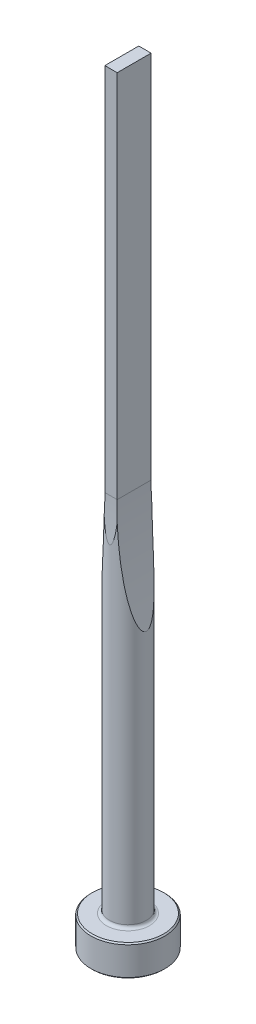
ISO-10303-21;
HEADER;
FILE_DESCRIPTION(('STEP AP214'),'2;1');
FILE_NAME('part.step','',(''),(''),'','','');
FILE_SCHEMA(('AUTOMOTIVE_DESIGN { 1 0 10303 214 1 1 1 1 }'));
ENDSEC;
DATA;
#1=APPLICATION_CONTEXT('core data for automotive mechanical design processes');
#2=APPLICATION_PROTOCOL_DEFINITION('international standard','automotive_design',2000,#1);
#3=PRODUCT_CONTEXT('',#1,'mechanical');
#4=PRODUCT('Part','Part','',(#3));
#5=PRODUCT_RELATED_PRODUCT_CATEGORY('part','',(#4));
#6=PRODUCT_DEFINITION_FORMATION('','',#4);
#7=PRODUCT_DEFINITION_CONTEXT('part definition',#1,'design');
#8=PRODUCT_DEFINITION('design','',#6,#7);
#9=PRODUCT_DEFINITION_SHAPE('','',#8);
#10=(LENGTH_UNIT() NAMED_UNIT(*) SI_UNIT(.MILLI.,.METRE.));
#11=(NAMED_UNIT(*) PLANE_ANGLE_UNIT() SI_UNIT($,.RADIAN.));
#12=(NAMED_UNIT(*) SI_UNIT($,.STERADIAN.) SOLID_ANGLE_UNIT());
#13=UNCERTAINTY_MEASURE_WITH_UNIT(LENGTH_MEASURE(1.E-05),#10,'distance_accuracy_value','');
#14=(GEOMETRIC_REPRESENTATION_CONTEXT(3) GLOBAL_UNCERTAINTY_ASSIGNED_CONTEXT((#13)) GLOBAL_UNIT_ASSIGNED_CONTEXT((#10,
#11,#12)) REPRESENTATION_CONTEXT('',''));
#15=CARTESIAN_POINT('',(0.,0.,0.));
#16=DIRECTION('',(0.,0.,1.));
#17=DIRECTION('',(1.,0.,0.));
#18=AXIS2_PLACEMENT_3D('',#15,#16,#17);
#19=CARTESIAN_POINT('',(0.,0.,0.));
#20=DIRECTION('',(0.,1.,0.));
#21=DIRECTION('',(-1.,0.,0.));
#22=AXIS2_PLACEMENT_3D('',#19,#20,#21);
#23=PLANE('',#22);
#24=CARTESIAN_POINT('',(0.,0.,0.));
#25=DIRECTION('',(0.,1.,0.));
#26=DIRECTION('',(-1.,0.,0.));
#27=AXIS2_PLACEMENT_3D('',#24,#25,#26);
#28=CIRCLE('',#27,5.8);
#29=CARTESIAN_POINT('',(-5.8,0.,0.));
#30=VERTEX_POINT('',#29);
#31=EDGE_CURVE('E133',#30,#30,#28,.T.);
#32=ORIENTED_EDGE('',*,*,#31,.F.);
#33=EDGE_LOOP('',(#32));
#34=FACE_BOUND('',#33,.T.);
#35=ADVANCED_FACE('F32',(#34),#23,.F.);
#36=CARTESIAN_POINT('',(0.,0.,0.));
#37=DIRECTION('',(0.,1.,0.));
#38=DIRECTION('',(-1.,0.,0.));
#39=AXIS2_PLACEMENT_3D('',#36,#37,#38);
#40=CONICAL_SURFACE('',#39,5.8,0.785398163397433);
#41=CARTESIAN_POINT('',(0.,0.200000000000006,0.));
#42=DIRECTION('',(0.,1.,0.));
#43=DIRECTION('',(-1.,0.,0.));
#44=AXIS2_PLACEMENT_3D('',#41,#42,#43);
#45=CIRCLE('',#44,6.);
#46=CARTESIAN_POINT('',(-6.,0.200000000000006,0.));
#47=VERTEX_POINT('',#46);
#48=EDGE_CURVE('E130',#47,#47,#45,.T.);
#49=ORIENTED_EDGE('',*,*,#48,.F.);
#50=EDGE_LOOP('',(#49));
#51=FACE_BOUND('',#50,.T.);
#52=ORIENTED_EDGE('',*,*,#31,.T.);
#53=EDGE_LOOP('',(#52));
#54=FACE_BOUND('',#53,.T.);
#55=ADVANCED_FACE('F171',(#51,#54),#40,.T.);
#56=CARTESIAN_POINT('',(0.,125.,0.));
#57=DIRECTION('',(0.,1.,0.));
#58=DIRECTION('',(-1.,0.,0.));
#59=AXIS2_PLACEMENT_3D('',#56,#57,#58);
#60=CYLINDRICAL_SURFACE('',#59,6.);
#61=CARTESIAN_POINT('',(0.,4.8,0.));
#62=DIRECTION('',(0.,1.,0.));
#63=DIRECTION('',(-1.,0.,0.));
#64=AXIS2_PLACEMENT_3D('',#61,#62,#63);
#65=CIRCLE('',#64,6.);
#66=CARTESIAN_POINT('',(-6.,4.8,0.));
#67=VERTEX_POINT('',#66);
#68=EDGE_CURVE('E127',#67,#67,#65,.T.);
#69=ORIENTED_EDGE('',*,*,#68,.F.);
#70=EDGE_LOOP('',(#69));
#71=FACE_BOUND('',#70,.T.);
#72=ORIENTED_EDGE('',*,*,#48,.T.);
#73=EDGE_LOOP('',(#72));
#74=FACE_BOUND('',#73,.T.);
#75=ADVANCED_FACE('F176',(#71,#74),#60,.T.);
#76=CARTESIAN_POINT('',(0.,4.8,0.));
#77=DIRECTION('',(0.,-1.,0.));
#78=DIRECTION('',(1.,0.,0.));
#79=AXIS2_PLACEMENT_3D('',#76,#77,#78);
#80=CONICAL_SURFACE('',#79,6.,0.785398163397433);
#81=CARTESIAN_POINT('',(0.,5.,0.));
#82=DIRECTION('',(0.,1.,0.));
#83=DIRECTION('',(-1.,0.,0.));
#84=AXIS2_PLACEMENT_3D('',#81,#82,#83);
#85=CIRCLE('',#84,5.8);
#86=CARTESIAN_POINT('',(-5.8,5.,0.));
#87=VERTEX_POINT('',#86);
#88=EDGE_CURVE('E124',#87,#87,#85,.T.);
#89=ORIENTED_EDGE('',*,*,#88,.F.);
#90=EDGE_LOOP('',(#89));
#91=FACE_BOUND('',#90,.T.);
#92=ORIENTED_EDGE('',*,*,#68,.T.);
#93=EDGE_LOOP('',(#92));
#94=FACE_BOUND('',#93,.T.);
#95=ADVANCED_FACE('F183',(#91,#94),#80,.T.);
#96=CARTESIAN_POINT('',(5.8,5.,0.));
#97=DIRECTION('',(0.,-1.,0.));
#98=DIRECTION('',(1.,0.,0.));
#99=AXIS2_PLACEMENT_3D('',#96,#97,#98);
#100=PLANE('',#99);
#101=CARTESIAN_POINT('',(0.,5.,0.));
#102=DIRECTION('',(0.,1.,0.));
#103=DIRECTION('',(-1.,0.,0.));
#104=AXIS2_PLACEMENT_3D('',#101,#102,#103);
#105=CIRCLE('',#104,3.50000000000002);
#106=CARTESIAN_POINT('',(-3.50000000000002,5.,0.));
#107=VERTEX_POINT('',#106);
#108=EDGE_CURVE('E121',#107,#107,#105,.T.);
#109=ORIENTED_EDGE('',*,*,#108,.F.);
#110=EDGE_LOOP('',(#109));
#111=FACE_BOUND('',#110,.T.);
#112=ORIENTED_EDGE('',*,*,#88,.T.);
#113=EDGE_LOOP('',(#112));
#114=FACE_BOUND('',#113,.T.);
#115=ADVANCED_FACE('F190',(#111,#114),#100,.F.);
#116=CARTESIAN_POINT('',(0.,5.5,0.));
#117=DIRECTION('',(0.,1.,0.));
#118=DIRECTION('',(-1.,0.,0.));
#119=AXIS2_PLACEMENT_3D('',#116,#117,#118);
#120=TOROIDAL_SURFACE('',#119,3.50000000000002,0.5);
#121=CARTESIAN_POINT('',(0.,5.50000000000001,0.));
#122=DIRECTION('',(0.,1.,0.));
#123=DIRECTION('',(-1.,0.,0.));
#124=AXIS2_PLACEMENT_3D('',#121,#122,#123);
#125=CIRCLE('',#124,3.00000000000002);
#126=CARTESIAN_POINT('',(-3.00000000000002,5.50000000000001,0.));
#127=VERTEX_POINT('',#126);
#128=EDGE_CURVE('E112',#127,#127,#125,.T.);
#129=ORIENTED_EDGE('',*,*,#128,.F.);
#130=EDGE_LOOP('',(#129));
#131=FACE_BOUND('',#130,.T.);
#132=ORIENTED_EDGE('',*,*,#108,.T.);
#133=EDGE_LOOP('',(#132));
#134=FACE_BOUND('',#133,.T.);
#135=ADVANCED_FACE('F168',(#131,#134),#120,.F.);
#136=CARTESIAN_POINT('',(0.,125.,0.));
#137=DIRECTION('',(0.,1.,0.));
#138=DIRECTION('',(-1.,0.,0.));
#139=AXIS2_PLACEMENT_3D('',#136,#137,#138);
#140=CYLINDRICAL_SURFACE('',#139,3.00000000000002);
#141=CARTESIAN_POINT('',(3.00000000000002,46.1320377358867,0.));
#142=CARTESIAN_POINT('',(3.00000022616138,46.1320366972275,0.0382289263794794));
#143=CARTESIAN_POINT('',(2.99926110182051,46.1354829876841,0.0764552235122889));
#144=CARTESIAN_POINT('',(2.99639888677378,46.1488399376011,0.151714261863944));
#145=CARTESIAN_POINT('',(2.99427413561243,46.1587583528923,0.188745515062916));
#146=CARTESIAN_POINT('',(2.98807781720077,46.187721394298,0.271228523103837));
#147=CARTESIAN_POINT('',(2.98362020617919,46.2085792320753,0.316004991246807));
#148=CARTESIAN_POINT('',(2.97331057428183,46.2569328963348,0.401613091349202));
#149=CARTESIAN_POINT('',(2.96745548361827,46.2844433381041,0.442435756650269));
#150=CARTESIAN_POINT('',(2.95008756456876,46.366275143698,0.549315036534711));
#151=CARTESIAN_POINT('',(2.93760642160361,46.4253156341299,0.611548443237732));
#152=CARTESIAN_POINT('',(2.91115377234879,46.5511686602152,0.727109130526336));
#153=CARTESIAN_POINT('',(2.89717771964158,46.6180049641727,0.780407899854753));
#154=CARTESIAN_POINT('',(2.86113354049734,46.7914444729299,0.90558449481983));
#155=CARTESIAN_POINT('',(2.83855915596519,46.901011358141,0.973158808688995));
#156=CARTESIAN_POINT('',(2.79269011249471,47.1258908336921,1.09783888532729));
#157=CARTESIAN_POINT('',(2.7693939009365,47.2412161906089,1.15491994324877));
#158=CARTESIAN_POINT('',(2.72247570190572,47.4759281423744,1.2615585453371));
#159=CARTESIAN_POINT('',(2.69885265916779,47.5953324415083,1.31107625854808));
#160=CARTESIAN_POINT('',(2.65169557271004,47.8363122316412,1.40399899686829));
#161=CARTESIAN_POINT('',(2.62816145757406,47.9578850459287,1.44741103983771));
#162=CARTESIAN_POINT('',(2.58116352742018,48.2034207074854,1.52965685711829));
#163=CARTESIAN_POINT('',(2.55770101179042,48.3273935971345,1.56846116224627));
#164=CARTESIAN_POINT('',(2.51108712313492,48.5765905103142,1.6420507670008));
#165=CARTESIAN_POINT('',(2.48793578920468,48.7018146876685,1.67683556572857));
#166=CARTESIAN_POINT('',(2.41902942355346,49.0790398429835,1.77618649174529));
#167=CARTESIAN_POINT('',(2.37384496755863,49.3324737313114,1.83571063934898));
#168=CARTESIAN_POINT('',(2.28521389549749,49.8423645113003,1.9449203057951));
#169=CARTESIAN_POINT('',(2.24177182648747,50.0988273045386,1.99458126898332));
#170=CARTESIAN_POINT('',(2.15691582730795,50.6133961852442,2.08604943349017));
#171=CARTESIAN_POINT('',(2.11550134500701,50.8715018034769,2.12785878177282));
#172=CARTESIAN_POINT('',(2.03467618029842,51.3897050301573,2.20527247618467));
#173=CARTESIAN_POINT('',(1.99527148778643,51.6498062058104,2.24085896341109));
#174=CARTESIAN_POINT('',(1.91865388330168,52.1710031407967,2.30679847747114));
#175=CARTESIAN_POINT('',(1.88144110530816,52.4320989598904,2.33715118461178));
#176=CARTESIAN_POINT('',(1.80931117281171,52.954648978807,2.39342463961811));
#177=CARTESIAN_POINT('',(1.77439043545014,53.2161019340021,2.41935241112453));
#178=CARTESIAN_POINT('',(1.70680986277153,53.739632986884,2.46749161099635));
#179=CARTESIAN_POINT('',(1.67414999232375,54.0017110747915,2.4897030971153));
#180=CARTESIAN_POINT('',(1.57940518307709,54.7902935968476,2.55171073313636));
#181=CARTESIAN_POINT('',(1.52076944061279,55.3175940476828,2.58671983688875));
#182=CARTESIAN_POINT('',(1.41278591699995,56.3737084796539,2.64723210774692));
#183=CARTESIAN_POINT('',(1.36343895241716,56.9025225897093,2.67273443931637));
#184=CARTESIAN_POINT('',(1.27407912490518,57.9614251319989,2.71646757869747));
#185=CARTESIAN_POINT('',(1.23406961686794,58.4915139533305,2.73469577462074));
#186=CARTESIAN_POINT('',(1.16344309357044,59.5524599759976,2.76547993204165));
#187=CARTESIAN_POINT('',(1.13282580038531,60.0833171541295,2.77803606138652));
#188=CARTESIAN_POINT('',(1.08091639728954,61.1473323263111,2.79864265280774));
#189=CARTESIAN_POINT('',(1.05965545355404,61.6804921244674,2.80667808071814));
#190=CARTESIAN_POINT('',(1.0266184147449,62.7471520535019,2.81892956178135));
#191=CARTESIAN_POINT('',(1.01484239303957,63.2806521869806,2.8231455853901));
#192=CARTESIAN_POINT('',(1.00078350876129,64.3476225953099,2.82815977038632));
#193=CARTESIAN_POINT('',(0.998497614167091,64.8810928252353,2.82895902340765));
#194=CARTESIAN_POINT('',(1.00341174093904,65.9479814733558,2.82721980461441));
#195=CARTESIAN_POINT('',(1.01061171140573,66.4813998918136,2.8246813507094));
#196=CARTESIAN_POINT('',(1.03447469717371,67.5471327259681,2.81602973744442));
#197=CARTESIAN_POINT('',(1.05112237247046,68.0794475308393,2.80992237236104));
#198=CARTESIAN_POINT('',(1.09386114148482,69.1436435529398,2.79356276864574));
#199=CARTESIAN_POINT('',(1.1199523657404,69.6755247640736,2.78331047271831));
#200=CARTESIAN_POINT('',(1.18158570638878,70.7390218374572,2.75771131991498));
#201=CARTESIAN_POINT('',(1.21713492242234,71.2706371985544,2.74236063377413));
#202=CARTESIAN_POINT('',(1.29764729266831,72.3329136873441,2.70519573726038));
#203=CARTESIAN_POINT('',(1.34261005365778,72.8635748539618,2.68338179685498));
#204=CARTESIAN_POINT('',(1.44167101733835,73.921123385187,2.63148216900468));
#205=CARTESIAN_POINT('',(1.49572528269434,74.4480167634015,2.60143584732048));
#206=CARTESIAN_POINT('',(1.61305086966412,75.5001668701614,2.53037775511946));
#207=CARTESIAN_POINT('',(1.6763238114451,76.0254232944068,2.48936405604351));
#208=CARTESIAN_POINT('',(1.7779808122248,76.8110512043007,2.41671078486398));
#209=CARTESIAN_POINT('',(1.81296647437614,77.0723841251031,2.39065784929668));
#210=CARTESIAN_POINT('',(1.8851643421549,77.5942622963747,2.33415203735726));
#211=CARTESIAN_POINT('',(1.92237646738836,77.8548075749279,2.30369931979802));
#212=CARTESIAN_POINT('',(1.99897145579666,78.3748259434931,2.23755936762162));
#213=CARTESIAN_POINT('',(2.03835358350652,78.6342993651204,2.20187389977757));
#214=CARTESIAN_POINT('',(2.11923244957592,79.1519525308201,2.12414949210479));
#215=CARTESIAN_POINT('',(2.16072897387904,79.4101324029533,2.0821111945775));
#216=CARTESIAN_POINT('',(2.22438951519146,79.7955347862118,2.01322026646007));
#217=CARTESIAN_POINT('',(2.24579780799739,79.9234162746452,1.98934230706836));
#218=CARTESIAN_POINT('',(2.28909512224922,80.1786729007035,1.9393656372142));
#219=CARTESIAN_POINT('',(2.31098417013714,80.3060480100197,1.91326680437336));
#220=CARTESIAN_POINT('',(2.35524194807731,80.5603194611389,1.85851444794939));
#221=CARTESIAN_POINT('',(2.37761118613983,80.6872151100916,1.82985810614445));
#222=CARTESIAN_POINT('',(2.42277149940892,80.9402353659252,1.76963159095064));
#223=CARTESIAN_POINT('',(2.44556255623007,81.0663600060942,1.73806154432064));
#224=CARTESIAN_POINT('',(2.49132183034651,81.3165535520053,1.67180247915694));
#225=CARTESIAN_POINT('',(2.51428679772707,81.440630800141,1.63714288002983));
#226=CARTESIAN_POINT('',(2.5605201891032,81.6875456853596,1.56384666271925));
#227=CARTESIAN_POINT('',(2.58378858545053,81.8103834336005,1.52521040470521));
#228=CARTESIAN_POINT('',(2.63049823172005,82.0542236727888,1.44315833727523));
#229=CARTESIAN_POINT('',(2.65393918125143,82.1752285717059,1.39974955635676));
#230=CARTESIAN_POINT('',(2.70086752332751,82.4148810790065,1.30691723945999));
#231=CARTESIAN_POINT('',(2.72435488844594,82.5335297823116,1.2574965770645));
#232=CARTESIAN_POINT('',(2.75720311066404,82.6977721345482,1.18253203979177));
#233=CARTESIAN_POINT('',(2.76665795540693,82.7448478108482,1.16026794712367));
#234=CARTESIAN_POINT('',(2.78550256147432,82.8382934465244,1.11426796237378));
#235=CARTESIAN_POINT('',(2.7948923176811,82.8846633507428,1.09053195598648));
#236=CARTESIAN_POINT('',(2.82298244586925,83.022830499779,1.01664624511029));
#237=CARTESIAN_POINT('',(2.84153288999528,83.1133315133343,0.963976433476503));
#238=CARTESIAN_POINT('',(2.87800082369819,83.28992665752,0.849014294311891));
#239=CARTESIAN_POINT('',(2.89590869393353,83.3759588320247,0.786619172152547));
#240=CARTESIAN_POINT('',(2.92128092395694,83.4970528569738,0.683622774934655));
#241=CARTESIAN_POINT('',(2.9294732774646,83.5360129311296,0.647814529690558));
#242=CARTESIAN_POINT('',(2.94512917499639,83.6102431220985,0.572450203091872));
#243=CARTESIAN_POINT('',(2.95259387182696,83.6455190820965,0.532900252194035));
#244=CARTESIAN_POINT('',(2.96507601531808,83.7043545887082,0.457682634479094));
#245=CARTESIAN_POINT('',(2.97028566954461,83.728852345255,0.4227898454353));
#246=CARTESIAN_POINT('',(2.97973939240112,83.7732319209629,0.349998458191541));
#247=CARTESIAN_POINT('',(2.98398345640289,83.7931137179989,0.312099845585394));
#248=CARTESIAN_POINT('',(2.99120737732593,83.8269149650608,0.232964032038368));
#249=CARTESIAN_POINT('',(2.99417050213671,83.8407555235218,0.191690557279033));
#250=CARTESIAN_POINT('',(2.99838013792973,83.8604085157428,0.107202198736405));
#251=CARTESIAN_POINT('',(2.99963012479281,83.8662372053,0.0639914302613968));
#252=CARTESIAN_POINT('',(3.0001963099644,83.8688778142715,-0.0181336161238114));
#253=CARTESIAN_POINT('',(2.99970295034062,83.8665777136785,-0.0570192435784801));
#254=CARTESIAN_POINT('',(2.99726373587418,83.8551966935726,-0.133743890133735));
#255=CARTESIAN_POINT('',(2.99531641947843,83.846108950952,-0.171581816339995));
#256=CARTESIAN_POINT('',(2.98959413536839,83.8193698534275,-0.253764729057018));
#257=CARTESIAN_POINT('',(2.98550081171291,83.8002248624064,-0.297592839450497));
#258=CARTESIAN_POINT('',(2.97593628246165,83.7553921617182,-0.381574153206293));
#259=CARTESIAN_POINT('',(2.97046224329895,83.7296909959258,-0.421719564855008));
#260=CARTESIAN_POINT('',(2.95432862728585,83.6537426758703,-0.525716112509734));
#261=CARTESIAN_POINT('',(2.94274979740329,83.5990377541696,-0.586122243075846));
#262=CARTESIAN_POINT('',(2.91810481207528,83.4819743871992,-0.698550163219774));
#263=CARTESIAN_POINT('',(2.90503417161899,83.4195928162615,-0.750545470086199));
#264=CARTESIAN_POINT('',(2.87174720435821,83.2598039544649,-0.870990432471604));
#265=CARTESIAN_POINT('',(2.85105828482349,83.1597081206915,-0.935696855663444));
#266=CARTESIAN_POINT('',(2.80892115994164,82.953961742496,-1.05544164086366));
#267=CARTESIAN_POINT('',(2.78747133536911,82.8482990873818,-1.11045768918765));
#268=CARTESIAN_POINT('',(2.74418685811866,82.6330247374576,-1.21349533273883));
#269=CARTESIAN_POINT('',(2.72235077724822,82.5233952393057,-1.26147873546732));
#270=CARTESIAN_POINT('',(2.67868820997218,82.301982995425,-1.35171430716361));
#271=CARTESIAN_POINT('',(2.65686174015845,82.1902027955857,-1.39397282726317));
#272=CARTESIAN_POINT('',(2.6137760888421,81.9672642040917,-1.47314729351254));
#273=CARTESIAN_POINT('',(2.59251428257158,81.8561379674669,-1.51015307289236));
#274=CARTESIAN_POINT('',(2.55020507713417,81.6327002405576,-1.58054872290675));
#275=CARTESIAN_POINT('',(2.52915770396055,81.5203886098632,-1.61393815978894));
#276=CARTESIAN_POINT('',(2.466412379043,81.1819801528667,-1.70957968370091));
#277=CARTESIAN_POINT('',(2.42513167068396,80.9545154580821,-1.7672688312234));
#278=CARTESIAN_POINT('',(2.34389066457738,80.4967254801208,-1.87366866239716));
#279=CARTESIAN_POINT('',(2.30393376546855,80.2663946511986,-1.92235751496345));
#280=CARTESIAN_POINT('',(2.22560869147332,79.804134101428,-2.01251797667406));
#281=CARTESIAN_POINT('',(2.18724009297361,79.5722048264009,-2.05399151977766));
#282=CARTESIAN_POINT('',(2.11209208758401,79.1065792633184,-2.13118981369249));
#283=CARTESIAN_POINT('',(2.07531657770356,78.8728801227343,-2.16690099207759));
#284=CARTESIAN_POINT('',(2.00351057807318,78.4045144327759,-2.233459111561));
#285=CARTESIAN_POINT('',(1.96848019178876,78.1698478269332,-2.26430576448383));
#286=CARTESIAN_POINT('',(1.90025903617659,77.7000948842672,-2.32185349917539));
#287=CARTESIAN_POINT('',(1.86706568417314,77.465009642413,-2.34856050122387));
#288=CARTESIAN_POINT('',(1.80249449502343,76.9942265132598,-2.39847310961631));
#289=CARTESIAN_POINT('',(1.77111663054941,76.7585286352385,-2.42167876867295));
#290=CARTESIAN_POINT('',(1.67974647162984,76.050729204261,-2.48678077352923));
#291=CARTESIAN_POINT('',(1.62250766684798,75.5778534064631,-2.52417022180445));
#292=CARTESIAN_POINT('',(1.51548416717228,74.6306110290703,-2.58983087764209));
#293=CARTESIAN_POINT('',(1.46570013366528,74.1562443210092,-2.61810127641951));
#294=CARTESIAN_POINT('',(1.373637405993,73.2062735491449,-2.66755500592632));
#295=CARTESIAN_POINT('',(1.33136100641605,72.7306691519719,-2.68873617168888));
#296=CARTESIAN_POINT('',(1.25436923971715,71.7786316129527,-2.72550422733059));
#297=CARTESIAN_POINT('',(1.21965398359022,71.302198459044,-2.74109103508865));
#298=CARTESIAN_POINT('',(1.157746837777,70.347774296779,-2.76780770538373));
#299=CARTESIAN_POINT('',(1.13056996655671,69.8697820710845,-2.77892869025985));
#300=CARTESIAN_POINT('',(1.08384507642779,68.9133518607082,-2.79748288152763));
#301=CARTESIAN_POINT('',(1.06429711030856,68.4349138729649,-2.80491606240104));
#302=CARTESIAN_POINT('',(1.03284197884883,67.4778381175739,-2.81665023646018));
#303=CARTESIAN_POINT('',(1.02093339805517,66.9992004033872,-2.82095180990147));
#304=CARTESIAN_POINT('',(1.0047561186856,66.0417807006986,-2.82675409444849));
#305=CARTESIAN_POINT('',(1.00048739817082,65.5629987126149,-2.82825481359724));
#306=CARTESIAN_POINT('',(0.999592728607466,64.6068472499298,-2.82857110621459));
#307=CARTESIAN_POINT('',(1.00294414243,64.1294777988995,-2.82739463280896));
#308=CARTESIAN_POINT('',(1.01724188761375,63.174865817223,-2.82228220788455));
#309=CARTESIAN_POINT('',(1.02818823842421,62.697623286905,-2.81834624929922));
#310=CARTESIAN_POINT('',(1.05767415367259,61.7433220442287,-2.80741397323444));
#311=CARTESIAN_POINT('',(1.0762150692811,61.2662633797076,-2.80041711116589));
#312=CARTESIAN_POINT('',(1.12088191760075,60.3125687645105,-2.78284043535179));
#313=CARTESIAN_POINT('',(1.14700780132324,59.8359328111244,-2.77226064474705));
#314=CARTESIAN_POINT('',(1.20678398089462,58.8840018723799,-2.74676682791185));
#315=CARTESIAN_POINT('',(1.24042234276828,58.4087059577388,-2.731859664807));
#316=CARTESIAN_POINT('',(1.31522508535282,57.4589081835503,-2.69664530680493));
#317=CARTESIAN_POINT('',(1.35638936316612,56.9844063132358,-2.67633818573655));
#318=CARTESIAN_POINT('',(1.44619587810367,56.0365906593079,-2.62889658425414));
#319=CARTESIAN_POINT('',(1.49483588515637,55.5632765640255,-2.60176413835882));
#320=CARTESIAN_POINT('',(1.59954373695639,54.6180706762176,-2.53874310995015));
#321=CARTESIAN_POINT('',(1.65561095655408,54.1461787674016,-2.50285526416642));
#322=CARTESIAN_POINT('',(1.74253420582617,53.4608699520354,-2.44226518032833));
#323=CARTESIAN_POINT('',(1.77048698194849,53.2466764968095,-2.42211858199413));
#324=CARTESIAN_POINT('',(1.82789751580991,52.8187546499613,-2.37909262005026));
#325=CARTESIAN_POINT('',(1.85735533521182,52.6050262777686,-2.356213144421));
#326=CARTESIAN_POINT('',(1.91774137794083,52.1782362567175,-2.3073310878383));
#327=CARTESIAN_POINT('',(1.94866890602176,51.9651743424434,-2.28132997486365));
#328=CARTESIAN_POINT('',(2.01197930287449,51.5397466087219,-2.22569407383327));
#329=CARTESIAN_POINT('',(2.04436213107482,51.3273807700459,-2.19605938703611));
#330=CARTESIAN_POINT('',(2.12282503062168,50.8248724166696,-2.12075062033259));
#331=CARTESIAN_POINT('',(2.16952977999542,50.5351034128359,-2.073204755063));
#332=CARTESIAN_POINT('',(2.2654773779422,49.95772259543,-1.9679227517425));
#333=CARTESIAN_POINT('',(2.31472085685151,49.6701113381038,-1.91018407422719));
#334=CARTESIAN_POINT('',(2.3999245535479,49.1864939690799,-1.80098498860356));
#335=CARTESIAN_POINT('',(2.43529880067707,48.9895864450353,-1.75307812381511));
#336=CARTESIAN_POINT('',(2.5069386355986,48.5982442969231,-1.64902256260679));
#337=CARTESIAN_POINT('',(2.54320352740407,48.4038079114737,-1.5928801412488));
#338=CARTESIAN_POINT('',(2.60534464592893,48.0765342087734,-1.48817918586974));
#339=CARTESIAN_POINT('',(2.63106114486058,47.9427769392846,-1.44242693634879));
#340=CARTESIAN_POINT('',(2.68266526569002,47.6775673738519,-1.34402450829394));
#341=CARTESIAN_POINT('',(2.7085531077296,47.5461195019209,-1.29136244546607));
#342=CARTESIAN_POINT('',(2.76181569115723,47.2787562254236,-1.17340697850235));
#343=CARTESIAN_POINT('',(2.78918019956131,47.1430889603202,-1.10752295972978));
#344=CARTESIAN_POINT('',(2.82944954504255,46.9456774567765,-0.997847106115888));
#345=CARTESIAN_POINT('',(2.84272536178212,46.8809733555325,-0.959540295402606));
#346=CARTESIAN_POINT('',(2.86883651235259,46.7543929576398,-0.878409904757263));
#347=CARTESIAN_POINT('',(2.88167220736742,46.6925143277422,-0.835590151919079));
#348=CARTESIAN_POINT('',(2.90412303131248,46.5848198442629,-0.753328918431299));
#349=CARTESIAN_POINT('',(2.91387080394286,46.5382576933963,-0.714910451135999));
#350=CARTESIAN_POINT('',(2.93264854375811,46.4488897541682,-0.633500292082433));
#351=CARTESIAN_POINT('',(2.94167693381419,46.4060921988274,-0.590499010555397));
#352=CARTESIAN_POINT('',(2.95868478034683,46.3257257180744,-0.498414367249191));
#353=CARTESIAN_POINT('',(2.96664701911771,46.2882421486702,-0.449251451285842));
#354=CARTESIAN_POINT('',(2.98058913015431,46.2227682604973,-0.344714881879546));
#355=CARTESIAN_POINT('',(2.98657844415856,46.1947327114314,-0.289372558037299));
#356=CARTESIAN_POINT('',(2.99392843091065,46.1603726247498,-0.19434456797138));
#357=CARTESIAN_POINT('',(2.99617998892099,46.1498617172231,-0.156258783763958));
#358=CARTESIAN_POINT('',(2.99921465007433,46.1356995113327,-0.0787798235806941));
#359=CARTESIAN_POINT('',(2.99999976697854,46.1320388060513,-0.0393885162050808));
#360=CARTESIAN_POINT('',(3.00000000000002,46.1320377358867,0.));
#361=B_SPLINE_CURVE_WITH_KNOTS('',3,(#141,#142,#143,#144,#145,#146,#147,#148,#149,#150,#151,
#152,#153,#154,#155,#156,#157,#158,#159,#160,#161,#162,#163,#164,#165,#166,#167,#168,#169,#170,
#171,#172,#173,#174,#175,#176,#177,#178,#179,#180,#181,#182,#183,#184,#185,#186,#187,#188,#189,
#190,#191,#192,#193,#194,#195,#196,#197,#198,#199,#200,#201,#202,#203,#204,#205,#206,#207,#208,
#209,#210,#211,#212,#213,#214,#215,#216,#217,#218,#219,#220,#221,#222,#223,#224,#225,#226,#227,
#228,#229,#230,#231,#232,#233,#234,#235,#236,#237,#238,#239,#240,#241,#242,#243,#244,#245,#246,
#247,#248,#249,#250,#251,#252,#253,#254,#255,#256,#257,#258,#259,#260,#261,#262,#263,#264,#265,
#266,#267,#268,#269,#270,#271,#272,#273,#274,#275,#276,#277,#278,#279,#280,#281,#282,#283,#284,
#285,#286,#287,#288,#289,#290,#291,#292,#293,#294,#295,#296,#297,#298,#299,#300,#301,#302,#303,
#304,#305,#306,#307,#308,#309,#310,#311,#312,#313,#314,#315,#316,#317,#318,#319,#320,#321,#322,
#323,#324,#325,#326,#327,#328,#329,#330,#331,#332,#333,#334,#335,#336,#337,#338,#339,#340,#341,
#342,#343,#344,#345,#346,#347,#348,#349,#350,#351,#352,#353,#354,#355,#356,#357,#358,#359,#360),
.UNSPECIFIED.,.T.,.F.,(4,2,2,2,2,2,2,2,2,2,2,2,2,2,2,2,2,2,2,2,2,2,2,2,2,2,2,2,2,2,2,2,2,2,2,2,
2,2,2,2,2,2,2,2,2,2,2,2,2,2,2,2,2,2,2,2,2,2,2,2,2,2,2,2,2,2,2,2,2,2,2,2,2,2,2,2,2,2,2,2,2,2,2,2,
2,2,2,2,2,2,2,2,2,2,2,2,2,2,2,2,2,2,2,2,2,2,2,2,2,4),(0.,0.114530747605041,0.229198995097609,
0.377146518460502,0.525422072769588,0.784016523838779,1.04342108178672,1.43450960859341,
1.8265074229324,2.22050328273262,2.61404251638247,3.00997666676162,3.40596010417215,
4.19830991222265,4.99260830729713,5.78668919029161,6.58301287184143,7.3793851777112,
8.17448141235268,8.9695652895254,10.5644564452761,12.1594877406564,13.7550912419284,
15.3506475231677,16.9514791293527,18.5523231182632,20.1526556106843,21.752979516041,
23.3507124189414,24.9484674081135,26.5474251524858,28.1463161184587,29.7376910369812,
31.3293459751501,32.1241543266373,32.9189339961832,33.7134459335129,34.5078775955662,
34.9033853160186,35.2989148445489,35.6948857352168,36.090839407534,36.4833596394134,
36.8758443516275,37.267758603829,37.6594862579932,37.8182445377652,37.9770151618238,
38.2957346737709,38.6180854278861,38.7785394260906,38.9387349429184,39.0673064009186,
39.1958784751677,39.3260826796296,39.456022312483,39.5722268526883,39.6885483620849,
39.8317500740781,39.9752480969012,40.2207965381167,40.4671036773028,40.8291068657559,
41.1919330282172,41.5566618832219,41.9209827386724,42.2780286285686,42.6351172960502,
43.3496348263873,44.0658633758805,44.7818996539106,45.4995985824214,46.2173400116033,
46.9340453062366,47.650739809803,49.0839199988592,50.517227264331,51.9509718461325,
53.3847374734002,54.8213393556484,56.2579511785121,57.6942967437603,59.1306381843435,
60.5627182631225,61.9948020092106,63.4271406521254,64.8594700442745,66.2895400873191,
67.7195905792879,69.1492153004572,70.5787197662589,71.2295431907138,71.8803933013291,
72.5309385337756,73.1814656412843,74.0733253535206,74.9654075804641,75.5824262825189,
76.1989772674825,76.6298882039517,77.0615502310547,77.5206861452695,77.7496251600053,
77.9783715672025,78.1616043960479,78.3452284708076,78.5315304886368,78.716927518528,
78.8350946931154,78.9530994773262),.UNSPECIFIED.);
#362=CARTESIAN_POINT('',(1.05745310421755,61.7846838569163,-2.80745310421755));
#363=VERTEX_POINT('',#362);
#364=CARTESIAN_POINT('',(1.05745310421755,61.7846838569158,2.80745310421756));
#365=VERTEX_POINT('',#364);
#366=EDGE_CURVE('E138',#363,#365,#361,.T.);
#367=ORIENTED_EDGE('',*,*,#366,.T.);
#368=CARTESIAN_POINT('',(-1.19895788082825,65.,2.74999999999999));
#369=CARTESIAN_POINT('',(-1.19897952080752,65.5078240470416,2.7500005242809));
#370=CARTESIAN_POINT('',(-1.18927252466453,66.0156821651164,2.7543014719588));
#371=CARTESIAN_POINT('',(-1.1587512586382,66.7777588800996,2.76719867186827));
#372=CARTESIAN_POINT('',(-1.1458730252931,67.0323726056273,2.77259034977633));
#373=CARTESIAN_POINT('',(-1.11408427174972,67.5410752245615,2.7855202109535));
#374=CARTESIAN_POINT('',(-1.09517627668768,67.7951642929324,2.79305749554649));
#375=CARTESIAN_POINT('',(-1.05054489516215,68.2992875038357,2.81014523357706));
#376=CARTESIAN_POINT('',(-1.02491501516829,68.5493308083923,2.81966772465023));
#377=CARTESIAN_POINT('',(-0.964932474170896,69.0487156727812,2.84076574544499));
#378=CARTESIAN_POINT('',(-0.930566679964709,69.2980555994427,2.85234435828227));
#379=CARTESIAN_POINT('',(-0.870049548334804,69.6696537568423,2.87113933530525));
#380=CARTESIAN_POINT('',(-0.848472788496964,69.7926943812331,2.87761721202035));
#381=CARTESIAN_POINT('',(-0.801568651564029,70.0380271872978,2.89103629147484));
#382=CARTESIAN_POINT('',(-0.776241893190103,70.1603194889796,2.89797741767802));
#383=CARTESIAN_POINT('',(-0.720753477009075,70.4034742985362,2.91227256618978));
#384=CARTESIAN_POINT('',(-0.690603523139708,70.5243395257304,2.9196255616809));
#385=CARTESIAN_POINT('',(-0.62352787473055,70.7641294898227,2.93469409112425));
#386=CARTESIAN_POINT('',(-0.586609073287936,70.8830560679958,2.94240925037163));
#387=CARTESIAN_POINT('',(-0.532225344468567,71.0331253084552,2.95243594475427));
#388=CARTESIAN_POINT('',(-0.519782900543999,71.0660915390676,2.95465705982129));
#389=CARTESIAN_POINT('',(-0.493824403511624,71.1316010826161,2.9591065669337));
#390=CARTESIAN_POINT('',(-0.480308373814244,71.1641444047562,2.96133495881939));
#391=CARTESIAN_POINT('',(-0.437923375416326,71.2607815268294,2.96800415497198));
#392=CARTESIAN_POINT('',(-0.407160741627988,71.3240456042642,2.97243989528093));
#393=CARTESIAN_POINT('',(-0.339480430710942,71.443295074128,2.98092262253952));
#394=CARTESIAN_POINT('',(-0.302974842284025,71.4994884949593,2.98497775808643));
#395=CARTESIAN_POINT('',(-0.24324965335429,71.5706099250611,2.99016761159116));
#396=CARTESIAN_POINT('',(-0.225380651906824,71.589912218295,2.99158318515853));
#397=CARTESIAN_POINT('',(-0.187063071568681,71.6257850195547,2.99422420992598));
#398=CARTESIAN_POINT('',(-0.166623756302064,71.642364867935,2.99545031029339));
#399=CARTESIAN_POINT('',(-0.132225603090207,71.6647469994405,2.99711026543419));
#400=CARTESIAN_POINT('',(-0.119296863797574,71.6721061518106,2.99765718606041));
#401=CARTESIAN_POINT('',(-0.0924786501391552,71.6848335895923,2.99860424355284));
#402=CARTESIAN_POINT('',(-0.0785901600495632,71.6902038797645,2.99900452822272));
#403=CARTESIAN_POINT('',(-0.0498799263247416,71.6984547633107,2.99961993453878));
#404=CARTESIAN_POINT('',(-0.0350488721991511,71.7013042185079,2.99983274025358));
#405=CARTESIAN_POINT('',(-0.00511706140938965,71.7039833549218,3.00003281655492));
#406=CARTESIAN_POINT('',(0.00998340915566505,71.7038160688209,3.00002031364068));
#407=CARTESIAN_POINT('',(0.0377473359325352,71.7007339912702,2.99979016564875));
#408=CARTESIAN_POINT('',(0.0504568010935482,71.6982058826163,2.99960139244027));
#409=CARTESIAN_POINT('',(0.0753269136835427,71.6912160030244,2.99908000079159));
#410=CARTESIAN_POINT('',(0.0874870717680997,71.6867525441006,2.99874725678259));
#411=CARTESIAN_POINT('',(0.117304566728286,71.6734908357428,2.99776000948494));
#412=CARTESIAN_POINT('',(0.134490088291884,71.6636473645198,2.99702831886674));
#413=CARTESIAN_POINT('',(0.167153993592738,71.6414692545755,2.99538445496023));
#414=CARTESIAN_POINT('',(0.182627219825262,71.6291273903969,2.99447175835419));
#415=CARTESIAN_POINT('',(0.225718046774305,71.5906116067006,2.99163284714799));
#416=CARTESIAN_POINT('',(0.251307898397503,71.56221507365,2.98955095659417));
#417=CARTESIAN_POINT('',(0.298583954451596,71.5023955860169,2.98519748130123));
#418=CARTESIAN_POINT('',(0.320256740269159,71.4709627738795,2.98292528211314));
#419=CARTESIAN_POINT('',(0.376076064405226,71.3821026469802,2.97655204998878));
#420=CARTESIAN_POINT('',(0.407351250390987,71.3228981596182,2.97236032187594));
#421=CARTESIAN_POINT('',(0.464715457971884,71.2019914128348,2.96392635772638));
#422=CARTESIAN_POINT('',(0.490790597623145,71.1402829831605,2.95968401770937));
#423=CARTESIAN_POINT('',(0.539393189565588,71.0151533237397,2.95121450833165));
#424=CARTESIAN_POINT('',(0.561903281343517,70.9517253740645,2.94698750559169));
#425=CARTESIAN_POINT('',(0.604138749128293,70.8240591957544,2.93861747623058));
#426=CARTESIAN_POINT('',(0.623867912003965,70.7598222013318,2.93447434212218));
#427=CARTESIAN_POINT('',(0.687009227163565,70.5416029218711,2.920637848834));
#428=CARTESIAN_POINT('',(0.725502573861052,70.3861879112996,2.91118093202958));
#429=CARTESIAN_POINT('',(0.794909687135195,70.07360906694,2.89298537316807));
#430=CARTESIAN_POINT('',(0.82581814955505,69.9164440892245,2.88424723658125));
#431=CARTESIAN_POINT('',(0.882130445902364,69.6006711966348,2.86752741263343));
#432=CARTESIAN_POINT('',(0.907519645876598,69.442060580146,2.85954776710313));
#433=CARTESIAN_POINT('',(0.95391227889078,69.1242228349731,2.8444044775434));
#434=CARTESIAN_POINT('',(0.974917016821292,68.9649959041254,2.8372405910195));
#435=CARTESIAN_POINT('',(1.03276252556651,68.485151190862,2.8169332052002));
#436=CARTESIAN_POINT('',(1.06419241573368,68.1638255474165,2.805051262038));
#437=CARTESIAN_POINT('',(1.11623470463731,67.5208794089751,2.78473743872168));
#438=CARTESIAN_POINT('',(1.13686835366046,67.1992607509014,2.7762987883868));
#439=CARTESIAN_POINT('',(1.16917424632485,66.5546671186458,2.76284984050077));
#440=CARTESIAN_POINT('',(1.18082300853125,66.2316907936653,2.75784852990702));
#441=CARTESIAN_POINT('',(1.19594203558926,65.5855107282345,2.75132454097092));
#442=CARTESIAN_POINT('',(1.19941212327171,65.2623069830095,2.74980193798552));
#443=CARTESIAN_POINT('',(1.19840705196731,64.6145622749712,2.75024017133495));
#444=CARTESIAN_POINT('',(1.19389860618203,64.2900213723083,2.75221560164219));
#445=CARTESIAN_POINT('',(1.1765647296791,63.6413194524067,2.75967187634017));
#446=CARTESIAN_POINT('',(1.16374248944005,63.317158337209,2.76515137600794));
#447=CARTESIAN_POINT('',(1.12903192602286,62.6736789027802,2.7795024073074));
#448=CARTESIAN_POINT('',(1.10726533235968,62.3543530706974,2.78832827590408));
#449=CARTESIAN_POINT('',(1.05280621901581,61.7162712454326,2.80935794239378));
#450=CARTESIAN_POINT('',(1.02009944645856,61.3975165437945,2.82156614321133));
#451=CARTESIAN_POINT('',(0.960080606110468,60.9219501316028,2.84230016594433));
#452=CARTESIAN_POINT('',(0.938338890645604,60.7643795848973,2.84958669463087));
#453=CARTESIAN_POINT('',(0.890325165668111,60.4498925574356,2.86495508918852));
#454=CARTESIAN_POINT('',(0.864051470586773,60.2929763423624,2.87303725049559));
#455=CARTESIAN_POINT('',(0.80570765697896,59.9806378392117,2.88993979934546));
#456=CARTESIAN_POINT('',(0.773651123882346,59.8252129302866,2.89875843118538));
#457=CARTESIAN_POINT('',(0.701473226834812,59.5163138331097,2.91708269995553));
#458=CARTESIAN_POINT('',(0.661358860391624,59.3628380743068,2.92658773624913));
#459=CARTESIAN_POINT('',(0.599571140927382,59.1622791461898,2.93951368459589));
#460=CARTESIAN_POINT('',(0.583753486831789,59.1133825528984,2.94270568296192));
#461=CARTESIAN_POINT('',(0.550376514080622,59.0161514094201,2.94913181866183));
#462=CARTESIAN_POINT('',(0.532816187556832,58.9678172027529,2.95236597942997));
#463=CARTESIAN_POINT('',(0.495474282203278,58.8718768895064,2.95886221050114));
#464=CARTESIAN_POINT('',(0.47568748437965,58.8242728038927,2.96212432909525));
#465=CARTESIAN_POINT('',(0.433230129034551,58.7303798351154,2.96863184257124));
#466=CARTESIAN_POINT('',(0.410562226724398,58.6840897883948,2.97187725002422));
#467=CARTESIAN_POINT('',(0.360948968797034,58.5932525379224,2.97831355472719));
#468=CARTESIAN_POINT('',(0.333963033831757,58.5487274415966,2.98150358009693));
#469=CARTESIAN_POINT('',(0.273823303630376,58.4640019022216,2.98763333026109));
#470=CARTESIAN_POINT('',(0.240714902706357,58.423772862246,2.99057467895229));
#471=CARTESIAN_POINT('',(0.187908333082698,58.3753088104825,2.99414413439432));
#472=CARTESIAN_POINT('',(0.172443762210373,58.3625865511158,2.9950843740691));
#473=CARTESIAN_POINT('',(0.139769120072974,58.3396025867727,2.99678704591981));
#474=CARTESIAN_POINT('',(0.122564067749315,58.3293340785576,2.99754996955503));
#475=CARTESIAN_POINT('',(0.0920979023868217,58.3150686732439,2.9986115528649));
#476=CARTESIAN_POINT('',(0.07929285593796,58.3101148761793,2.99898077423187));
#477=CARTESIAN_POINT('',(0.0530412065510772,58.3023526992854,2.99955968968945));
#478=CARTESIAN_POINT('',(0.0395953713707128,58.2995418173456,2.99976956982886));
#479=CARTESIAN_POINT('',(0.0123234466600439,58.2963783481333,3.00000579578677));
#480=CARTESIAN_POINT('',(-0.00150445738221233,58.2960408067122,3.00003101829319));
#481=CARTESIAN_POINT('',(-0.0289863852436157,58.2979088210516,2.99989150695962));
#482=CARTESIAN_POINT('',(-0.0426403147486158,58.30011570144,2.99972667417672));
#483=CARTESIAN_POINT('',(-0.0713132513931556,58.3072893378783,2.99919143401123));
#484=CARTESIAN_POINT('',(-0.0862409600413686,58.3126116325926,2.99879455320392));
#485=CARTESIAN_POINT('',(-0.115034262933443,58.3255893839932,2.9978285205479));
#486=CARTESIAN_POINT('',(-0.128897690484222,58.3332494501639,2.99725902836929));
#487=CARTESIAN_POINT('',(-0.163968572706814,58.3556775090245,2.99559526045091));
#488=CARTESIAN_POINT('',(-0.184247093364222,58.3718697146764,2.99439742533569));
#489=CARTESIAN_POINT('',(-0.222285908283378,58.4069419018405,2.99181430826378));
#490=CARTESIAN_POINT('',(-0.240038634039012,58.4258296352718,2.99042848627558));
#491=CARTESIAN_POINT('',(-0.280818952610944,58.4738008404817,2.98692562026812));
#492=CARTESIAN_POINT('',(-0.302801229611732,58.5037572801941,2.98475182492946));
#493=CARTESIAN_POINT('',(-0.343876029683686,58.5656071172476,2.98029708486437));
#494=CARTESIAN_POINT('',(-0.362961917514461,58.5975047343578,2.97801590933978));
#495=CARTESIAN_POINT('',(-0.417189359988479,58.6952833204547,2.97107815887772));
#496=CARTESIAN_POINT('',(-0.449076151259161,58.762946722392,2.96634960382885));
#497=CARTESIAN_POINT('',(-0.507522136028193,58.9004515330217,2.95690285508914));
#498=CARTESIAN_POINT('',(-0.534078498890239,58.9702940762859,2.95218466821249));
#499=CARTESIAN_POINT('',(-0.583437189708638,59.1113147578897,2.9428266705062));
#500=CARTESIAN_POINT('',(-0.606238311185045,59.1824933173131,2.93818688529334));
#501=CARTESIAN_POINT('',(-0.670588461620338,59.3976071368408,2.92442540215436));
#502=CARTESIAN_POINT('',(-0.707956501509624,59.5427891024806,2.91548441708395));
#503=CARTESIAN_POINT('',(-0.775545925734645,59.8347309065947,2.89822529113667));
#504=CARTESIAN_POINT('',(-0.805769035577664,59.9814903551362,2.88990700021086));
#505=CARTESIAN_POINT('',(-0.860937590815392,60.2758101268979,2.87395360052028));
#506=CARTESIAN_POINT('',(-0.885890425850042,60.4233690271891,2.86631754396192));
#507=CARTESIAN_POINT('',(-0.937056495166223,60.7534864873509,2.85005332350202));
#508=CARTESIAN_POINT('',(-0.962216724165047,60.936215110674,2.84160657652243));
#509=CARTESIAN_POINT('',(-1.00766798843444,61.3023321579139,2.8258050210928));
#510=CARTESIAN_POINT('',(-1.02795847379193,61.4857206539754,2.81845033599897));
#511=CARTESIAN_POINT('',(-1.08284239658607,62.0369289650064,2.79803797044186));
#512=CARTESIAN_POINT('',(-1.11139411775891,62.4054154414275,2.78665055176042));
#513=CARTESIAN_POINT('',(-1.15618392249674,63.1449701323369,2.76835525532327));
#514=CARTESIAN_POINT('',(-1.17236247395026,63.5160422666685,2.7614690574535));
#515=CARTESIAN_POINT('',(-1.19373453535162,64.2580705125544,2.75229417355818));
#516=CARTESIAN_POINT('',(-1.19894207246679,64.6290261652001,2.74999961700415));
#517=CARTESIAN_POINT('',(-1.19895788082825,65.,2.74999999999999));
#518=B_SPLINE_CURVE_WITH_KNOTS('',3,(#368,#369,#370,#371,#372,#373,#374,#375,#376,#377,#378,
#379,#380,#381,#382,#383,#384,#385,#386,#387,#388,#389,#390,#391,#392,#393,#394,#395,#396,#397,
#398,#399,#400,#401,#402,#403,#404,#405,#406,#407,#408,#409,#410,#411,#412,#413,#414,#415,#416,
#417,#418,#419,#420,#421,#422,#423,#424,#425,#426,#427,#428,#429,#430,#431,#432,#433,#434,#435,
#436,#437,#438,#439,#440,#441,#442,#443,#444,#445,#446,#447,#448,#449,#450,#451,#452,#453,#454,
#455,#456,#457,#458,#459,#460,#461,#462,#463,#464,#465,#466,#467,#468,#469,#470,#471,#472,#473,
#474,#475,#476,#477,#478,#479,#480,#481,#482,#483,#484,#485,#486,#487,#488,#489,#490,#491,#492,
#493,#494,#495,#496,#497,#498,#499,#500,#501,#502,#503,#504,#505,#506,#507,#508,#509,#510,#511,
#512,#513,#514,#515,#516,#517),.UNSPECIFIED.,.T.,.F.,(4,2,2,2,2,2,2,2,2,2,2,2,2,2,2,2,2,2,2,2,2,
2,2,2,2,2,2,2,2,2,2,2,2,2,2,2,2,2,2,2,2,2,2,2,2,2,2,2,2,2,2,2,2,2,2,2,2,2,2,2,2,2,2,2,2,2,2,2,2,
2,2,2,2,2,4),(0.,1.5233619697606,2.2882920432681,3.05290220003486,3.80739350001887,
4.56302584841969,4.93824292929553,5.31339817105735,5.68765649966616,6.06153579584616,
6.1674401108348,6.27334211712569,6.48462856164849,6.68472896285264,6.76359605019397,
6.84218663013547,6.88671949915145,6.93120735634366,6.9762373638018,7.02122210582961,
7.05992905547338,7.09866983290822,7.15778245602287,7.21706854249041,7.33127335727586,
7.44586227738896,7.64659681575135,7.84786026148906,8.0500755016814,8.25201266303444,
8.73281405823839,9.21395072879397,9.69634794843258,10.1786013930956,11.1475377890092,
12.1145597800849,13.084100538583,14.053662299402,15.0272786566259,16.0005216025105,
16.960936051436,17.9226066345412,18.4002500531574,18.8780715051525,19.3547847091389,
19.8310857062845,19.9855333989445,20.1400709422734,20.2949785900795,20.4497444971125,
20.6060609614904,20.7612618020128,20.8212505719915,20.8810710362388,20.922124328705,
20.9631296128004,21.0043841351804,21.0456601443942,21.0929554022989,21.1403445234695,
21.2178364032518,21.2955558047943,21.4069345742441,21.5185647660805,21.7429487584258,
21.9674515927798,22.1920264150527,22.6422403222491,23.0923453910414,23.541815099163,
24.0956643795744,24.6495761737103,25.7585400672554,26.8728066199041,27.9856476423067),.UNSPECIFIED.);
#519=CARTESIAN_POINT('',(-1.05745310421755,61.7846838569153,2.80745310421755));
#520=VERTEX_POINT('',#519);
#521=EDGE_CURVE('E104',#365,#520,#518,.T.);
#522=ORIENTED_EDGE('',*,*,#521,.T.);
#523=CARTESIAN_POINT('',(-3.00000000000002,46.1320377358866,0.));
#524=CARTESIAN_POINT('',(-3.00000022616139,46.1320366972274,-0.0382289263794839));
#525=CARTESIAN_POINT('',(-2.99926110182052,46.135482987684,-0.0764552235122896));
#526=CARTESIAN_POINT('',(-2.99639888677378,46.148839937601,-0.151714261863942));
#527=CARTESIAN_POINT('',(-2.99427413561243,46.1587583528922,-0.188745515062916));
#528=CARTESIAN_POINT('',(-2.98807781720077,46.1877213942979,-0.271228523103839));
#529=CARTESIAN_POINT('',(-2.98362020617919,46.2085792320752,-0.316004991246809));
#530=CARTESIAN_POINT('',(-2.97331057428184,46.2569328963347,-0.401613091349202));
#531=CARTESIAN_POINT('',(-2.96745548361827,46.284443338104,-0.442435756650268));
#532=CARTESIAN_POINT('',(-2.95008756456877,46.3662751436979,-0.549315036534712));
#533=CARTESIAN_POINT('',(-2.93760642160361,46.4253156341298,-0.611548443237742));
#534=CARTESIAN_POINT('',(-2.91115377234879,46.551168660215,-0.727109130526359));
#535=CARTESIAN_POINT('',(-2.89717771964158,46.6180049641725,-0.78040789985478));
#536=CARTESIAN_POINT('',(-2.86113354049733,46.7914444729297,-0.905584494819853));
#537=CARTESIAN_POINT('',(-2.83855915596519,46.9010113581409,-0.973158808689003));
#538=CARTESIAN_POINT('',(-2.79269011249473,47.125890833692,-1.09783888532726));
#539=CARTESIAN_POINT('',(-2.76939390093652,47.2412161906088,-1.15491994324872));
#540=CARTESIAN_POINT('',(-2.72247570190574,47.4759281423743,-1.26155854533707));
#541=CARTESIAN_POINT('',(-2.69885265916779,47.5953324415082,-1.31107625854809));
#542=CARTESIAN_POINT('',(-2.65169557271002,47.8363122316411,-1.40399899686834));
#543=CARTESIAN_POINT('',(-2.62816145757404,47.9578850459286,-1.44741103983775));
#544=CARTESIAN_POINT('',(-2.58116352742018,48.2034207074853,-1.5296568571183));
#545=CARTESIAN_POINT('',(-2.55770101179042,48.3273935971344,-1.56846116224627));
#546=CARTESIAN_POINT('',(-2.51108712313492,48.5765905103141,-1.64205076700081));
#547=CARTESIAN_POINT('',(-2.48793578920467,48.7018146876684,-1.67683556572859));
#548=CARTESIAN_POINT('',(-2.41902942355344,49.0790398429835,-1.77618649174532));
#549=CARTESIAN_POINT('',(-2.37384496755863,49.3324737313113,-1.83571063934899));
#550=CARTESIAN_POINT('',(-2.28521389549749,49.8423645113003,-1.94492030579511));
#551=CARTESIAN_POINT('',(-2.24177182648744,50.0988273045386,-1.99458126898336));
#552=CARTESIAN_POINT('',(-2.15691582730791,50.6133961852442,-2.08604943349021));
#553=CARTESIAN_POINT('',(-2.11550134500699,50.871501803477,-2.12785878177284));
#554=CARTESIAN_POINT('',(-2.03467618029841,51.3897050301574,-2.20527247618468));
#555=CARTESIAN_POINT('',(-1.9952714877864,51.6498062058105,-2.24085896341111));
#556=CARTESIAN_POINT('',(-1.91865388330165,52.1710031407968,-2.30679847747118));
#557=CARTESIAN_POINT('',(-1.88144110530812,52.4320989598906,-2.33715118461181));
#558=CARTESIAN_POINT('',(-1.80931117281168,52.9546489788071,-2.39342463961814));
#559=CARTESIAN_POINT('',(-1.77439043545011,53.2161019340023,-2.41935241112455));
#560=CARTESIAN_POINT('',(-1.7068098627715,53.7396329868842,-2.46749161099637));
#561=CARTESIAN_POINT('',(-1.67414999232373,54.0017110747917,-2.48970309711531));
#562=CARTESIAN_POINT('',(-1.57940518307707,54.7902935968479,-2.55171073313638));
#563=CARTESIAN_POINT('',(-1.52076944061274,55.3175940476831,-2.58671983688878));
#564=CARTESIAN_POINT('',(-1.41278591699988,56.3737084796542,-2.64723210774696));
#565=CARTESIAN_POINT('',(-1.36343895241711,56.9025225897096,-2.67273443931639));
#566=CARTESIAN_POINT('',(-1.27407912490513,57.9614251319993,-2.71646757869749));
#567=CARTESIAN_POINT('',(-1.23406961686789,58.4915139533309,-2.73469577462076));
#568=CARTESIAN_POINT('',(-1.16344309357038,59.552459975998,-2.76547993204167));
#569=CARTESIAN_POINT('',(-1.13282580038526,60.0833171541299,-2.77803606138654));
#570=CARTESIAN_POINT('',(-1.0809163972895,61.1473323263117,-2.79864265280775));
#571=CARTESIAN_POINT('',(-1.05965545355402,61.680492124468,-2.80667808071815));
#572=CARTESIAN_POINT('',(-1.02661841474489,62.7471520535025,-2.81892956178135));
#573=CARTESIAN_POINT('',(-1.01484239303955,63.2806521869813,-2.82314558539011));
#574=CARTESIAN_POINT('',(-1.00078350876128,64.3476225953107,-2.82815977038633));
#575=CARTESIAN_POINT('',(-0.99849761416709,64.881092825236,-2.82895902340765));
#576=CARTESIAN_POINT('',(-1.00341174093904,65.9479814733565,-2.82721980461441));
#577=CARTESIAN_POINT('',(-1.01061171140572,66.4813998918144,-2.8246813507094));
#578=CARTESIAN_POINT('',(-1.03447469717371,67.547132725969,-2.81602973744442));
#579=CARTESIAN_POINT('',(-1.05112237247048,68.0794475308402,-2.80992237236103));
#580=CARTESIAN_POINT('',(-1.09386114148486,69.1436435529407,-2.79356276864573));
#581=CARTESIAN_POINT('',(-1.11995236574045,69.6755247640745,-2.7833104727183));
#582=CARTESIAN_POINT('',(-1.18158570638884,70.7390218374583,-2.75771131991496));
#583=CARTESIAN_POINT('',(-1.21713492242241,71.2706371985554,-2.74236063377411));
#584=CARTESIAN_POINT('',(-1.2976472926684,72.3329136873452,-2.70519573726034));
#585=CARTESIAN_POINT('',(-1.34261005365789,72.863574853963,-2.68338179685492));
#586=CARTESIAN_POINT('',(-1.44167101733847,73.9211233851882,-2.63148216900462));
#587=CARTESIAN_POINT('',(-1.49572528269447,74.4480167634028,-2.60143584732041));
#588=CARTESIAN_POINT('',(-1.61305086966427,75.5001668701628,-2.53037775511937));
#589=CARTESIAN_POINT('',(-1.67632381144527,76.0254232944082,-2.4893640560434));
#590=CARTESIAN_POINT('',(-1.777980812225,76.8110512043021,-2.41671078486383));
#591=CARTESIAN_POINT('',(-1.81296647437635,77.0723841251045,-2.39065784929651));
#592=CARTESIAN_POINT('',(-1.88516434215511,77.5942622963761,-2.33415203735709));
#593=CARTESIAN_POINT('',(-1.92237646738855,77.8548075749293,-2.30369931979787));
#594=CARTESIAN_POINT('',(-1.99897145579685,78.3748259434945,-2.23755936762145));
#595=CARTESIAN_POINT('',(-2.03835358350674,78.6342993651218,-2.20187389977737));
#596=CARTESIAN_POINT('',(-2.11923244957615,79.1519525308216,-2.12414949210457));
#597=CARTESIAN_POINT('',(-2.16072897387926,79.4101324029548,-2.08211119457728));
#598=CARTESIAN_POINT('',(-2.22438951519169,79.7955347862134,-2.01322026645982));
#599=CARTESIAN_POINT('',(-2.24579780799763,79.9234162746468,-1.9893423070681));
#600=CARTESIAN_POINT('',(-2.28909512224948,80.178672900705,-1.93936563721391));
#601=CARTESIAN_POINT('',(-2.3109841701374,80.3060480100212,-1.91326680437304));
#602=CARTESIAN_POINT('',(-2.35524194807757,80.5603194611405,-1.85851444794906));
#603=CARTESIAN_POINT('',(-2.37761118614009,80.6872151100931,-1.82985810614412));
#604=CARTESIAN_POINT('',(-2.42277149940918,80.9402353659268,-1.76963159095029));
#605=CARTESIAN_POINT('',(-2.44556255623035,81.0663600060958,-1.73806154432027));
#606=CARTESIAN_POINT('',(-2.49132183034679,81.3165535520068,-1.67180247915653));
#607=CARTESIAN_POINT('',(-2.51428679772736,81.4406308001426,-1.6371428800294));
#608=CARTESIAN_POINT('',(-2.56052018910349,81.6875456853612,-1.56384666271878));
#609=CARTESIAN_POINT('',(-2.58378858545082,81.810383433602,-1.52521040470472));
#610=CARTESIAN_POINT('',(-2.63049823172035,82.0542236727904,-1.4431583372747));
#611=CARTESIAN_POINT('',(-2.65393918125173,82.1752285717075,-1.39974955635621));
#612=CARTESIAN_POINT('',(-2.70086752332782,82.4148810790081,-1.30691723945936));
#613=CARTESIAN_POINT('',(-2.72435488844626,82.5335297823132,-1.25749657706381));
#614=CARTESIAN_POINT('',(-2.75720311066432,82.6977721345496,-1.18253203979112));
#615=CARTESIAN_POINT('',(-2.76665795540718,82.7448478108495,-1.16026794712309));
#616=CARTESIAN_POINT('',(-2.78550256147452,82.8382934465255,-1.11426796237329));
#617=CARTESIAN_POINT('',(-2.79489231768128,82.8846633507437,-1.09053195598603));
#618=CARTESIAN_POINT('',(-2.82298244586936,83.0228304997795,-1.01664624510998));
#619=CARTESIAN_POINT('',(-2.84153288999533,83.1133315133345,-0.963976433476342));
#620=CARTESIAN_POINT('',(-2.87800082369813,83.2899266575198,-0.84901429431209));
#621=CARTESIAN_POINT('',(-2.89590869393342,83.3759588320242,-0.786619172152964));
#622=CARTESIAN_POINT('',(-2.92128092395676,83.497052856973,-0.683622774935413));
#623=CARTESIAN_POINT('',(-2.92947327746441,83.5360129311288,-0.647814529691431));
#624=CARTESIAN_POINT('',(-2.94512917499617,83.6102431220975,-0.572450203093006));
#625=CARTESIAN_POINT('',(-2.95259387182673,83.6455190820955,-0.532900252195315));
#626=CARTESIAN_POINT('',(-2.96507601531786,83.7043545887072,-0.457682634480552));
#627=CARTESIAN_POINT('',(-2.9702856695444,83.7288523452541,-0.422789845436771));
#628=CARTESIAN_POINT('',(-2.97973939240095,83.7732319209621,-0.349998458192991));
#629=CARTESIAN_POINT('',(-2.98398345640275,83.7931137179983,-0.31209984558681));
#630=CARTESIAN_POINT('',(-2.99120737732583,83.8269149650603,-0.232964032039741));
#631=CARTESIAN_POINT('',(-2.99417050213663,83.8407555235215,-0.191690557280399));
#632=CARTESIAN_POINT('',(-2.99838013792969,83.8604085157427,-0.107202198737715));
#633=CARTESIAN_POINT('',(-2.99963012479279,83.8662372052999,-0.0639914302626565));
#634=CARTESIAN_POINT('',(-3.00019630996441,83.8688778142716,0.018133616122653));
#635=CARTESIAN_POINT('',(-2.99970295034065,83.8665777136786,0.0570192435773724));
#636=CARTESIAN_POINT('',(-2.99726373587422,83.8551966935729,0.13374389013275));
#637=CARTESIAN_POINT('',(-2.99531641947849,83.8461089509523,0.171581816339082));
#638=CARTESIAN_POINT('',(-2.98959413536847,83.8193698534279,0.253764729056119));
#639=CARTESIAN_POINT('',(-2.98550081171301,83.8002248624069,0.297592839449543));
#640=CARTESIAN_POINT('',(-2.97593628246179,83.7553921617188,0.381574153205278));
#641=CARTESIAN_POINT('',(-2.9704622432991,83.7296909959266,0.421719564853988));
#642=CARTESIAN_POINT('',(-2.95432862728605,83.6537426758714,0.525716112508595));
#643=CARTESIAN_POINT('',(-2.94274979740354,83.5990377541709,0.586122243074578));
#644=CARTESIAN_POINT('',(-2.91810481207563,83.4819743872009,0.698550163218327));
#645=CARTESIAN_POINT('',(-2.90503417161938,83.4195928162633,0.750545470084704));
#646=CARTESIAN_POINT('',(-2.87174720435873,83.2598039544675,0.870990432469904));
#647=CARTESIAN_POINT('',(-2.85105828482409,83.1597081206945,0.93569685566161));
#648=CARTESIAN_POINT('',(-2.80892115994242,82.9539617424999,1.05544164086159));
#649=CARTESIAN_POINT('',(-2.78747133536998,82.8482990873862,1.11045768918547));
#650=CARTESIAN_POINT('',(-2.7441868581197,82.6330247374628,1.21349533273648));
#651=CARTESIAN_POINT('',(-2.72235077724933,82.5233952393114,1.26147873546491));
#652=CARTESIAN_POINT('',(-2.67868820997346,82.3019829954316,1.35171430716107));
#653=CARTESIAN_POINT('',(-2.65686174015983,82.1902027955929,1.39397282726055));
#654=CARTESIAN_POINT('',(-2.61377608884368,81.9672642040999,1.47314729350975));
#655=CARTESIAN_POINT('',(-2.59251428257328,81.8561379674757,1.51015307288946));
#656=CARTESIAN_POINT('',(-2.55020507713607,81.6327002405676,1.58054872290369));
#657=CARTESIAN_POINT('',(-2.52915770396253,81.5203886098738,1.61393815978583));
#658=CARTESIAN_POINT('',(-2.46641237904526,81.1819801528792,1.70957968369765));
#659=CARTESIAN_POINT('',(-2.42513167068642,80.9545154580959,1.76726883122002));
#660=CARTESIAN_POINT('',(-2.34389066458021,80.496725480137,1.87366866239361));
#661=CARTESIAN_POINT('',(-2.30393376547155,80.266394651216,1.92235751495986));
#662=CARTESIAN_POINT('',(-2.22560869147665,79.804134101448,2.01251797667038));
#663=CARTESIAN_POINT('',(-2.18724009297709,79.5722048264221,2.05399151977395));
#664=CARTESIAN_POINT('',(-2.11209208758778,79.106579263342,2.13118981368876));
#665=CARTESIAN_POINT('',(-2.07531657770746,78.8728801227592,2.16690099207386));
#666=CARTESIAN_POINT('',(-2.00351057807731,78.4045144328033,2.23345911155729));
#667=CARTESIAN_POINT('',(-1.968480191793,78.1698478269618,2.26430576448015));
#668=CARTESIAN_POINT('',(-1.90025903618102,77.7000948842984,2.32185349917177));
#669=CARTESIAN_POINT('',(-1.86706568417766,77.4650096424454,2.34856050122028));
#670=CARTESIAN_POINT('',(-1.80249449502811,76.9942265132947,2.3984731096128));
#671=CARTESIAN_POINT('',(-1.77111663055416,76.7585286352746,2.42167876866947));
#672=CARTESIAN_POINT('',(-1.67974647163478,76.0507292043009,2.48678077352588));
#673=CARTESIAN_POINT('',(-1.62250766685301,75.5778534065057,2.52417022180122));
#674=CARTESIAN_POINT('',(-1.51548416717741,74.630611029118,2.5898308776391));
#675=CARTESIAN_POINT('',(-1.46570013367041,74.1562443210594,2.61810127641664));
#676=CARTESIAN_POINT('',(-1.37363740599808,73.2062735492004,2.66755500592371));
#677=CARTESIAN_POINT('',(-1.33136100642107,72.73066915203,2.6887361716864));
#678=CARTESIAN_POINT('',(-1.25436923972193,71.7786316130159,2.72550422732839));
#679=CARTESIAN_POINT('',(-1.21965398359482,71.3021984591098,2.7410910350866));
#680=CARTESIAN_POINT('',(-1.1577468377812,70.34777429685,2.76780770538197));
#681=CARTESIAN_POINT('',(-1.1305699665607,69.8697820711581,2.77892869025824));
#682=CARTESIAN_POINT('',(-1.08384507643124,68.913351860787,2.7974828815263));
#683=CARTESIAN_POINT('',(-1.06429711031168,68.4349138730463,2.80491606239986));
#684=CARTESIAN_POINT('',(-1.03284197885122,67.4778381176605,2.8166502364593));
#685=CARTESIAN_POINT('',(-1.02093339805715,66.9992004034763,2.82095180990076));
#686=CARTESIAN_POINT('',(-1.00475611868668,66.0417807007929,2.82675409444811));
#687=CARTESIAN_POINT('',(-1.00048739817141,65.5629987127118,2.82825481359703));
#688=CARTESIAN_POINT('',(-0.999592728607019,64.6068472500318,2.82857110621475));
#689=CARTESIAN_POINT('',(-1.002944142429,64.129477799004,2.82739463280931));
#690=CARTESIAN_POINT('',(-1.01724188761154,63.1748658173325,2.82228220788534));
#691=CARTESIAN_POINT('',(-1.02818823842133,62.697623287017,2.81834624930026));
#692=CARTESIAN_POINT('',(-1.05767415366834,61.7433220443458,2.80741397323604));
#693=CARTESIAN_POINT('',(-1.07621506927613,61.2662633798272,2.80041711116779));
#694=CARTESIAN_POINT('',(-1.12088191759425,60.3125687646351,2.7828404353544));
#695=CARTESIAN_POINT('',(-1.14700780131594,59.8359328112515,2.77226064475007));
#696=CARTESIAN_POINT('',(-1.20678398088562,58.8840018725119,2.74676682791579));
#697=CARTESIAN_POINT('',(-1.24042234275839,58.4087059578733,2.73185966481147));
#698=CARTESIAN_POINT('',(-1.3152250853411,57.4589081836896,2.69664530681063));
#699=CARTESIAN_POINT('',(-1.35638936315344,56.9844063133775,2.67633818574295));
#700=CARTESIAN_POINT('',(-1.446195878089,56.0365906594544,2.62889658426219));
#701=CARTESIAN_POINT('',(-1.49483588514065,55.5632765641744,2.60176413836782));
#702=CARTESIAN_POINT('',(-1.59954373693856,54.6180706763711,2.53874310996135));
#703=CARTESIAN_POINT('',(-1.65561095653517,54.1461787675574,2.50285526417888));
#704=CARTESIAN_POINT('',(-1.74253420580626,53.4608699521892,2.44226518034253));
#705=CARTESIAN_POINT('',(-1.77048698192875,53.2466764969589,2.42211858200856));
#706=CARTESIAN_POINT('',(-1.82789751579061,52.8187546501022,2.37909262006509));
#707=CARTESIAN_POINT('',(-1.85735533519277,52.6050262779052,2.35621314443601));
#708=CARTESIAN_POINT('',(-1.91774137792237,52.1782362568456,2.30733108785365));
#709=CARTESIAN_POINT('',(-1.94866890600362,51.9651743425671,2.28132997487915));
#710=CARTESIAN_POINT('',(-2.01197930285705,51.5397466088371,2.22569407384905));
#711=CARTESIAN_POINT('',(-2.04436213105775,51.3273807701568,2.19605938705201));
#712=CARTESIAN_POINT('',(-2.12282503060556,50.8248724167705,2.12075062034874));
#713=CARTESIAN_POINT('',(-2.16952977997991,50.535103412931,2.07320475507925));
#714=CARTESIAN_POINT('',(-2.26547737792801,49.9577225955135,1.96792275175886));
#715=CARTESIAN_POINT('',(-2.31472085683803,49.6701113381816,1.91018407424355));
#716=CARTESIAN_POINT('',(-2.39992455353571,49.1864939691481,1.80098498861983));
#717=CARTESIAN_POINT('',(-2.43529880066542,48.9895864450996,1.75307812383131));
#718=CARTESIAN_POINT('',(-2.50693863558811,48.5982442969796,1.64902256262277));
#719=CARTESIAN_POINT('',(-2.54320352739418,48.4038079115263,1.59288014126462));
#720=CARTESIAN_POINT('',(-2.60534464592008,48.0765342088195,1.48817918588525));
#721=CARTESIAN_POINT('',(-2.63106114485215,47.942776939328,1.44242693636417));
#722=CARTESIAN_POINT('',(-2.68266526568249,47.6775673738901,1.34402450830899));
#723=CARTESIAN_POINT('',(-2.70855310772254,47.5461195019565,1.2913624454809));
#724=CARTESIAN_POINT('',(-2.76181569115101,47.2787562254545,1.173406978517));
#725=CARTESIAN_POINT('',(-2.78918019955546,47.143088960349,1.10752295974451));
#726=CARTESIAN_POINT('',(-2.8294495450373,46.9456774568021,0.997847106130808));
#727=CARTESIAN_POINT('',(-2.84272536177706,46.880973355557,0.959540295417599));
#728=CARTESIAN_POINT('',(-2.86883651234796,46.7543929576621,0.878409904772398));
#729=CARTESIAN_POINT('',(-2.88167220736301,46.6925143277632,0.835590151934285));
#730=CARTESIAN_POINT('',(-2.90412303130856,46.5848198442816,0.753328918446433));
#731=CARTESIAN_POINT('',(-2.91387080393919,46.5382576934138,0.714910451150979));
#732=CARTESIAN_POINT('',(-2.93264854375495,46.4488897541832,0.633500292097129));
#733=CARTESIAN_POINT('',(-2.94167693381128,46.4060921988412,0.590499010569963));
#734=CARTESIAN_POINT('',(-2.95868478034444,46.3257257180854,0.498414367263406));
#735=CARTESIAN_POINT('',(-2.9666470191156,46.2882421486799,0.449251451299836));
#736=CARTESIAN_POINT('',(-2.98058913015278,46.2227682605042,0.344714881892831));
#737=CARTESIAN_POINT('',(-2.98657844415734,46.194732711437,0.289372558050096));
#738=CARTESIAN_POINT('',(-2.99392843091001,46.1603726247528,0.194344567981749));
#739=CARTESIAN_POINT('',(-2.99617998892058,46.1498617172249,0.156258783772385));
#740=CARTESIAN_POINT('',(-2.99921465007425,46.1356995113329,0.0787798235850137));
#741=CARTESIAN_POINT('',(-2.99999976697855,46.1320388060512,0.0393885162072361));
#742=CARTESIAN_POINT('',(-3.00000000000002,46.1320377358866,0.));
#743=B_SPLINE_CURVE_WITH_KNOTS('',3,(#523,#524,#525,#526,#527,#528,#529,#530,#531,#532,#533,
#534,#535,#536,#537,#538,#539,#540,#541,#542,#543,#544,#545,#546,#547,#548,#549,#550,#551,#552,
#553,#554,#555,#556,#557,#558,#559,#560,#561,#562,#563,#564,#565,#566,#567,#568,#569,#570,#571,
#572,#573,#574,#575,#576,#577,#578,#579,#580,#581,#582,#583,#584,#585,#586,#587,#588,#589,#590,
#591,#592,#593,#594,#595,#596,#597,#598,#599,#600,#601,#602,#603,#604,#605,#606,#607,#608,#609,
#610,#611,#612,#613,#614,#615,#616,#617,#618,#619,#620,#621,#622,#623,#624,#625,#626,#627,#628,
#629,#630,#631,#632,#633,#634,#635,#636,#637,#638,#639,#640,#641,#642,#643,#644,#645,#646,#647,
#648,#649,#650,#651,#652,#653,#654,#655,#656,#657,#658,#659,#660,#661,#662,#663,#664,#665,#666,
#667,#668,#669,#670,#671,#672,#673,#674,#675,#676,#677,#678,#679,#680,#681,#682,#683,#684,#685,
#686,#687,#688,#689,#690,#691,#692,#693,#694,#695,#696,#697,#698,#699,#700,#701,#702,#703,#704,
#705,#706,#707,#708,#709,#710,#711,#712,#713,#714,#715,#716,#717,#718,#719,#720,#721,#722,#723,
#724,#725,#726,#727,#728,#729,#730,#731,#732,#733,#734,#735,#736,#737,#738,#739,#740,#741,#742),
.UNSPECIFIED.,.T.,.F.,(4,2,2,2,2,2,2,2,2,2,2,2,2,2,2,2,2,2,2,2,2,2,2,2,2,2,2,2,2,2,2,2,2,2,2,2,
2,2,2,2,2,2,2,2,2,2,2,2,2,2,2,2,2,2,2,2,2,2,2,2,2,2,2,2,2,2,2,2,2,2,2,2,2,2,2,2,2,2,2,2,2,2,2,2,
2,2,2,2,2,2,2,2,2,2,2,2,2,2,2,2,2,2,2,2,2,2,2,2,2,4),(0.,0.11453074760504,0.229198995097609,
0.377146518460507,0.525422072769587,0.784016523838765,1.04342108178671,1.4345096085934,
1.8265074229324,2.22050328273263,2.61404251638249,3.00997666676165,3.40596010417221,
4.19830991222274,4.99260830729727,5.78668919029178,6.58301287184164,7.37938517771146,
8.17448141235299,8.96956528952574,10.5644564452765,12.1594877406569,13.755091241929,
15.3506475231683,16.9514791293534,18.552323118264,20.1526556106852,21.7529795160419,
23.3507124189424,24.9484674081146,26.547425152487,28.1463161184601,29.7376910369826,
31.3293459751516,32.1241543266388,32.9189339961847,33.7134459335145,34.5078775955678,
34.9033853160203,35.2989148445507,35.6948857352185,36.0908394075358,36.4833596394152,
36.8758443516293,37.2677586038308,37.6594862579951,37.8182445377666,37.9770151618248,
38.295734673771,38.6180854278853,38.7785394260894,38.9387349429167,39.067306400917,
39.1958784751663,39.3260826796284,39.4560223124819,39.5722268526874,39.6885483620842,
39.8317500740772,39.9752480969,40.2207965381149,40.4671036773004,40.8291068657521,
41.191933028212,41.5566618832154,41.9209827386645,42.2780286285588,42.6351172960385,
43.3496348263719,44.0658633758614,44.7818996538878,45.4995985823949,46.2173400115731,
46.9340453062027,47.6507398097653,49.0839199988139,50.517227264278,51.9509718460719,
53.3847374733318,54.8213393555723,56.2579511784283,57.6942967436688,59.1306381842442,
60.5627182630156,61.9948020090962,63.4271406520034,64.8594700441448,66.2895400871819,
67.7195905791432,69.149215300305,70.5787197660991,71.2295431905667,71.8803933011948,
72.530938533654,73.1814656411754,74.0733253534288,74.9654075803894,75.5824262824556,
76.1989772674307,76.6298882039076,77.0615502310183,77.5206861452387,77.7496251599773,
77.9783715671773,78.161604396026,78.3452284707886,78.531530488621,78.7169275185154,
78.8350946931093,78.9530994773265),.UNSPECIFIED.);
#744=CARTESIAN_POINT('',(-1.05745310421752,61.7846838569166,-2.80745310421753));
#745=VERTEX_POINT('',#744);
#746=EDGE_CURVE('E103',#520,#745,#743,.T.);
#747=ORIENTED_EDGE('',*,*,#746,.T.);
#748=CARTESIAN_POINT('',(0.,58.2964561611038,-3.00000000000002));
#749=CARTESIAN_POINT('',(0.0139850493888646,58.2964599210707,-2.99999971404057));
#750=CARTESIAN_POINT('',(0.0279863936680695,58.2977840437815,-2.9999007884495));
#751=CARTESIAN_POINT('',(0.0555397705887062,58.3029147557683,-2.99951779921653));
#752=CARTESIAN_POINT('',(0.0690903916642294,58.3067284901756,-2.99923320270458));
#753=CARTESIAN_POINT('',(0.0991985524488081,58.3178094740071,-2.99840743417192));
#754=CARTESIAN_POINT('',(0.115501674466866,58.3257540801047,-2.99781604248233));
#755=CARTESIAN_POINT('',(0.146643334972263,58.3440879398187,-2.99645455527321));
#756=CARTESIAN_POINT('',(0.161478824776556,58.3544821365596,-2.99568409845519));
#757=CARTESIAN_POINT('',(0.201154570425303,58.3859467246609,-2.99335844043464));
#758=CARTESIAN_POINT('',(0.224475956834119,58.4088936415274,-2.99166944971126));
#759=CARTESIAN_POINT('',(0.267813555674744,58.4576729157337,-2.98810069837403));
#760=CARTESIAN_POINT('',(0.287818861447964,58.4835143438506,-2.98622033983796));
#761=CARTESIAN_POINT('',(0.337097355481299,58.5535139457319,-2.98115969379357));
#762=CARTESIAN_POINT('',(0.364378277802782,58.5990522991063,-2.97789947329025));
#763=CARTESIAN_POINT('',(0.414797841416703,58.6923947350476,-2.97129244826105));
#764=CARTESIAN_POINT('',(0.437925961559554,58.7402041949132,-2.9679454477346));
#765=CARTESIAN_POINT('',(0.481308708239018,58.8374159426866,-2.96122039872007));
#766=CARTESIAN_POINT('',(0.501546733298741,58.886825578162,-2.95784228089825));
#767=CARTESIAN_POINT('',(0.539710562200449,58.9864439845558,-2.95111560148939));
#768=CARTESIAN_POINT('',(0.557639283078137,59.0366516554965,-2.94776700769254));
#769=CARTESIAN_POINT('',(0.61355687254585,59.2023337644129,-2.9368586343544));
#770=CARTESIAN_POINT('',(0.647836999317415,59.3190617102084,-2.92939678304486));
#771=CARTESIAN_POINT('',(0.710447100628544,59.554144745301,-2.91483663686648));
#772=CARTESIAN_POINT('',(0.738772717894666,59.6725009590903,-2.90773861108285));
#773=CARTESIAN_POINT('',(0.791092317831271,59.9104708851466,-2.8939432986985));
#774=CARTESIAN_POINT('',(0.815076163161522,60.0300868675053,-2.88724697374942));
#775=CARTESIAN_POINT('',(0.859609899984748,60.2699853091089,-2.87430026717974));
#776=CARTESIAN_POINT('',(0.880159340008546,60.3902678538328,-2.86804994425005));
#777=CARTESIAN_POINT('',(0.937657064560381,60.7519037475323,-2.84998926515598));
#778=CARTESIAN_POINT('',(0.970436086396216,60.9939550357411,-2.83887444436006));
#779=CARTESIAN_POINT('',(1.02785174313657,61.4787242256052,-2.81858486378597));
#780=CARTESIAN_POINT('',(1.05249948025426,61.7214407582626,-2.80940746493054));
#781=CARTESIAN_POINT('',(1.09373009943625,62.1898259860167,-2.79360078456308));
#782=CARTESIAN_POINT('',(1.1107692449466,62.4154503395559,-2.78683470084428));
#783=CARTESIAN_POINT('',(1.14002071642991,62.8670603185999,-2.77499454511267));
#784=CARTESIAN_POINT('',(1.1522327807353,63.093045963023,-2.76992056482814));
#785=CARTESIAN_POINT('',(1.18241838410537,63.7716502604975,-2.75724513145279));
#786=CARTESIAN_POINT('',(1.19391666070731,64.2246182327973,-2.75220026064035));
#787=CARTESIAN_POINT('',(1.20133917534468,65.1294589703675,-2.74895867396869));
#788=CARTESIAN_POINT('',(1.19730509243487,65.5813314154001,-2.75074363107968));
#789=CARTESIAN_POINT('',(1.17323632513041,66.4844036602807,-2.76111026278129));
#790=CARTESIAN_POINT('',(1.15320937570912,66.9356036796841,-2.76968865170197));
#791=CARTESIAN_POINT('',(1.10884406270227,67.6108538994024,-2.78759651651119));
#792=CARTESIAN_POINT('',(1.09169254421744,67.8354541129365,-2.79439649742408));
#793=CARTESIAN_POINT('',(1.05179292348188,68.2842011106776,-2.80966185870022));
#794=CARTESIAN_POINT('',(1.02904266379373,68.5083476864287,-2.81812788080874));
#795=CARTESIAN_POINT('',(0.976614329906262,68.9563952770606,-2.83672313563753));
#796=CARTESIAN_POINT('',(0.946917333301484,69.1802939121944,-2.84685688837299));
#797=CARTESIAN_POINT('',(0.878527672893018,69.6264674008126,-2.86871398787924));
#798=CARTESIAN_POINT('',(0.839844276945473,69.8487436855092,-2.88043569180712));
#799=CARTESIAN_POINT('',(0.771654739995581,70.1805168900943,-2.89915358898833));
#800=CARTESIAN_POINT('',(0.747168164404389,70.2910665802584,-2.90559695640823));
#801=CARTESIAN_POINT('',(0.693654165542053,70.5112929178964,-2.91883701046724));
#802=CARTESIAN_POINT('',(0.664617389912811,70.6209672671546,-2.92563440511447));
#803=CARTESIAN_POINT('',(0.600269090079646,70.838659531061,-2.93952222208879));
#804=CARTESIAN_POINT('',(0.564951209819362,70.9466756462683,-2.9466129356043));
#805=CARTESIAN_POINT('',(0.504572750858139,71.1056985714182,-2.95733174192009));
#806=CARTESIAN_POINT('',(0.483253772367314,71.1581229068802,-2.96091255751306));
#807=CARTESIAN_POINT('',(0.437232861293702,71.2614488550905,-2.96805905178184));
#808=CARTESIAN_POINT('',(0.412535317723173,71.3123523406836,-2.97162474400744));
#809=CARTESIAN_POINT('',(0.357822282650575,71.4124150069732,-2.97871555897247));
#810=CARTESIAN_POINT('',(0.327716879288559,71.4615245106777,-2.98223871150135));
#811=CARTESIAN_POINT('',(0.25974824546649,71.5538349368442,-2.9889323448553));
#812=CARTESIAN_POINT('',(0.222016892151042,71.5971178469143,-2.99210756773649));
#813=CARTESIAN_POINT('',(0.164749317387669,71.6430244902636,-2.99549956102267));
#814=CARTESIAN_POINT('',(0.151153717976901,71.6527916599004,-2.99622323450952));
#815=CARTESIAN_POINT('',(0.12269558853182,71.670317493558,-2.99752405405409));
#816=CARTESIAN_POINT('',(0.107834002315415,71.678077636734,-2.99810130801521));
#817=CARTESIAN_POINT('',(0.0799128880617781,71.6896251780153,-2.99896132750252));
#818=CARTESIAN_POINT('',(0.067054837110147,71.6938891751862,-2.99927934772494));
#819=CARTESIAN_POINT('',(0.0408044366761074,71.700211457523,-2.99975110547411));
#820=CARTESIAN_POINT('',(0.0274127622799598,71.7022724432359,-2.9999050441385));
#821=CARTESIAN_POINT('',(0.000415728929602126,71.7039511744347,-3.00003042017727));
#822=CARTESIAN_POINT('',(-0.0131902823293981,71.7035588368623,-3.00000110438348));
#823=CARTESIAN_POINT('',(-0.0401135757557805,71.7003583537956,-2.99976211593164));
#824=CARTESIAN_POINT('',(-0.0534306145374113,71.6975482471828,-2.99955229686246));
#825=CARTESIAN_POINT('',(-0.0822851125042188,71.6889803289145,-2.99891329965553));
#826=CARTESIAN_POINT('',(-0.0976670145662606,71.6827102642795,-2.99844603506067));
#827=CARTESIAN_POINT('',(-0.127227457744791,71.6678080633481,-2.99733769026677));
#828=CARTESIAN_POINT('',(-0.141403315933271,71.6591708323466,-2.99669623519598));
#829=CARTESIAN_POINT('',(-0.178093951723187,71.6335622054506,-2.99479898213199));
#830=CARTESIAN_POINT('',(-0.19947435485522,71.6149974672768,-2.99342808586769));
#831=CARTESIAN_POINT('',(-0.239434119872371,71.5751065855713,-2.99049699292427));
#832=CARTESIAN_POINT('',(-0.258004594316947,71.5537720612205,-2.98893622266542));
#833=CARTESIAN_POINT('',(-0.301822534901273,71.4982509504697,-2.98489627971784));
#834=CARTESIAN_POINT('',(-0.325711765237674,71.4630107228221,-2.98235103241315));
#835=CARTESIAN_POINT('',(-0.370171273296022,71.3904739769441,-2.97715790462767));
#836=CARTESIAN_POINT('',(-0.390733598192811,71.353172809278,-2.97450979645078));
#837=CARTESIAN_POINT('',(-0.429502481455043,71.2771220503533,-2.96916017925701));
#838=CARTESIAN_POINT('',(-0.447695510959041,71.2383656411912,-2.9664584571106));
#839=CARTESIAN_POINT('',(-0.482149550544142,71.1600713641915,-2.9610526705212));
#840=CARTESIAN_POINT('',(-0.498412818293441,71.1205344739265,-2.95834861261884));
#841=CARTESIAN_POINT('',(-0.546628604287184,70.9967766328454,-2.94996809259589));
#842=CARTESIAN_POINT('',(-0.576012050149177,70.9115561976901,-2.94431594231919));
#843=CARTESIAN_POINT('',(-0.630303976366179,70.7396772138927,-2.93316664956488));
#844=CARTESIAN_POINT('',(-0.655209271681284,70.6530176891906,-2.92766961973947));
#845=CARTESIAN_POINT('',(-0.72509700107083,70.3913199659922,-2.91145474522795));
#846=CARTESIAN_POINT('',(-0.765117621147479,70.2149447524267,-2.90103908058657));
#847=CARTESIAN_POINT('',(-0.836853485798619,69.8601606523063,-2.88114808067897));
#848=CARTESIAN_POINT('',(-0.868550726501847,69.681748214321,-2.87167481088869));
#849=CARTESIAN_POINT('',(-0.925709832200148,69.3241667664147,-2.85376220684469));
#850=CARTESIAN_POINT('',(-0.951181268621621,69.1449993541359,-2.84532129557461));
#851=CARTESIAN_POINT('',(-0.99729421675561,68.7859678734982,-2.82948647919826));
#852=CARTESIAN_POINT('',(-1.01793460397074,68.6061036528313,-2.82209281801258));
#853=CARTESIAN_POINT('',(-1.05519589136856,68.2459166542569,-2.80837163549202));
#854=CARTESIAN_POINT('',(-1.07181661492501,68.065593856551,-2.80204416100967));
#855=CARTESIAN_POINT('',(-1.11652699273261,67.5240481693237,-2.7846753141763));
#856=CARTESIAN_POINT('',(-1.13945342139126,67.1623423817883,-2.77525168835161));
#857=CARTESIAN_POINT('',(-1.17413729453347,66.4374862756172,-2.76074848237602));
#858=CARTESIAN_POINT('',(-1.18586828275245,66.0743345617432,-2.75567919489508));
#859=CARTESIAN_POINT('',(-1.19912010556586,65.3478030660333,-2.74993888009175));
#860=CARTESIAN_POINT('',(-1.20064069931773,64.9844232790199,-2.74926795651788));
#861=CARTESIAN_POINT('',(-1.19363024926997,64.2595658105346,-2.75231968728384));
#862=CARTESIAN_POINT('',(-1.18514868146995,63.8980875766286,-2.75602071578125));
#863=CARTESIAN_POINT('',(-1.15744421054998,63.1754951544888,-2.76776951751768));
#864=CARTESIAN_POINT('',(-1.13821793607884,62.814381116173,-2.77581865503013));
#865=CARTESIAN_POINT('',(-1.08720430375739,62.0939707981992,-2.79620930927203));
#866=CARTESIAN_POINT('',(-1.05544707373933,61.7346722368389,-2.80854052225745));
#867=CARTESIAN_POINT('',(-0.995213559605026,61.1973558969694,-2.83019105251));
#868=CARTESIAN_POINT('',(-0.973042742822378,61.0185638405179,-2.83793134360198));
#869=CARTESIAN_POINT('',(-0.923505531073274,60.6617551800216,-2.8544411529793));
#870=CARTESIAN_POINT('',(-0.896139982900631,60.4837384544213,-2.86321050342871));
#871=CARTESIAN_POINT('',(-0.855196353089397,60.2475797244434,-2.87554329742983));
#872=CARTESIAN_POINT('',(-0.844636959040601,60.1888876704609,-2.87866617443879));
#873=CARTESIAN_POINT('',(-0.822678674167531,60.0716627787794,-2.88501828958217));
#874=CARTESIAN_POINT('',(-0.811279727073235,60.0131299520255,-2.88824753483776));
#875=CARTESIAN_POINT('',(-0.775683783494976,59.8378302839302,-2.89809018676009));
#876=CARTESIAN_POINT('',(-0.750085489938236,59.7213493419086,-2.90485918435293));
#877=CARTESIAN_POINT('',(-0.702735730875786,59.5258168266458,-2.91660040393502));
#878=CARTESIAN_POINT('',(-0.682283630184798,59.4464485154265,-2.92147274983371));
#879=CARTESIAN_POINT('',(-0.638405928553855,59.288595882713,-2.9313709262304));
#880=CARTESIAN_POINT('',(-0.61498162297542,59.2101111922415,-2.93639668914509));
#881=CARTESIAN_POINT('',(-0.554482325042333,59.0242583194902,-2.94854046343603));
#882=CARTESIAN_POINT('',(-0.515626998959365,58.917425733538,-2.95571778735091));
#883=CARTESIAN_POINT('',(-0.44827070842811,58.7623731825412,-2.96640099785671));
#884=CARTESIAN_POINT('',(-0.42460623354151,58.7120667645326,-2.96991113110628));
#885=CARTESIAN_POINT('',(-0.372917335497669,58.6137842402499,-2.97684899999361));
#886=CARTESIAN_POINT('',(-0.344904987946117,58.5658021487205,-2.98027693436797));
#887=CARTESIAN_POINT('',(-0.299760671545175,58.5001304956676,-2.98501737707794));
#888=CARTESIAN_POINT('',(-0.285369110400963,58.4805801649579,-2.98643541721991));
#889=CARTESIAN_POINT('',(-0.254888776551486,58.4427382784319,-2.9891918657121));
#890=CARTESIAN_POINT('',(-0.238795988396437,58.4244498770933,-2.99053007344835));
#891=CARTESIAN_POINT('',(-0.204303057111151,58.3896499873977,-2.99308616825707));
#892=CARTESIAN_POINT('',(-0.185874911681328,58.3731655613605,-2.99430220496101));
#893=CARTESIAN_POINT('',(-0.14642739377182,58.3436180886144,-2.99648866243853));
#894=CARTESIAN_POINT('',(-0.125421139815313,58.3305386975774,-2.99746025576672));
#895=CARTESIAN_POINT('',(-0.0905547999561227,58.3144276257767,-2.99865930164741));
#896=CARTESIAN_POINT('',(-0.0775824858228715,58.3095027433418,-2.99902640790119));
#897=CARTESIAN_POINT('',(-0.0510126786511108,58.3018745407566,-2.99959537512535));
#898=CARTESIAN_POINT('',(-0.0374173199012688,58.2991641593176,-2.99979776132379));
#899=CARTESIAN_POINT('',(-0.0158288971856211,58.29687505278,-2.99996871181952));
#900=CARTESIAN_POINT('',(-0.00791705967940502,58.2964540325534,-3.00000016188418));
#901=CARTESIAN_POINT('',(0.,58.2964561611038,-3.00000000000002));
#902=B_SPLINE_CURVE_WITH_KNOTS('',3,(#748,#749,#750,#751,#752,#753,#754,#755,#756,#757,#758,
#759,#760,#761,#762,#763,#764,#765,#766,#767,#768,#769,#770,#771,#772,#773,#774,#775,#776,#777,
#778,#779,#780,#781,#782,#783,#784,#785,#786,#787,#788,#789,#790,#791,#792,#793,#794,#795,#796,
#797,#798,#799,#800,#801,#802,#803,#804,#805,#806,#807,#808,#809,#810,#811,#812,#813,#814,#815,
#816,#817,#818,#819,#820,#821,#822,#823,#824,#825,#826,#827,#828,#829,#830,#831,#832,#833,#834,
#835,#836,#837,#838,#839,#840,#841,#842,#843,#844,#845,#846,#847,#848,#849,#850,#851,#852,#853,
#854,#855,#856,#857,#858,#859,#860,#861,#862,#863,#864,#865,#866,#867,#868,#869,#870,#871,#872,
#873,#874,#875,#876,#877,#878,#879,#880,#881,#882,#883,#884,#885,#886,#887,#888,#889,#890,#891,
#892,#893,#894,#895,#896,#897,#898,#899,#900,#901),.UNSPECIFIED.,.T.,.F.,(4,2,2,2,2,2,2,2,2,2,2,
2,2,2,2,2,2,2,2,2,2,2,2,2,2,2,2,2,2,2,2,2,2,2,2,2,2,2,2,2,2,2,2,2,2,2,2,2,2,2,2,2,2,2,2,2,2,2,2,
2,2,2,2,2,2,2,2,2,2,2,2,2,2,2,2,2,4),(0.,0.041925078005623,0.0839710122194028,0.138095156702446,
0.192329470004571,0.290061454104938,0.388108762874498,0.547249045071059,0.706786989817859,
0.867207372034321,1.02742308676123,1.39278505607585,1.75841345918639,2.12488483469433,
2.49140434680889,3.224720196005,3.95703061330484,4.63606627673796,5.3151387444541,
6.6741806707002,8.02957833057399,9.38432084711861,10.0603350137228,10.7366100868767,
11.4147491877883,12.0921919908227,12.4323559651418,12.7732285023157,13.114447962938,
13.2845036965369,13.4543405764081,13.6273187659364,13.7975284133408,13.847668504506,
13.8977715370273,13.9382597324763,13.9786982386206,14.0193030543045,14.059940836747,
14.1095134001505,14.1591935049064,14.2437592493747,14.3285871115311,14.4562121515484,
14.5841379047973,14.7127647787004,14.8412396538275,15.1119821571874,15.3829164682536,
15.9259984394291,16.4702456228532,17.0136507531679,17.5571822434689,18.1007376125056,
19.1881336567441,20.2780930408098,21.3680781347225,22.4526941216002,23.5376506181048,
24.6200143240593,25.1609441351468,25.7017858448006,25.8809288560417,26.0600838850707,
26.4183546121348,26.6646166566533,26.9107717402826,27.251870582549,27.4188815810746,
27.5854367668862,27.6583261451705,27.7313915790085,27.8054350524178,27.8791162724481,
27.9206046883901,27.9619602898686,27.9856944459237),.UNSPECIFIED.);
#903=EDGE_CURVE('E115',#745,#363,#902,.T.);
#904=ORIENTED_EDGE('',*,*,#903,.T.);
#905=EDGE_LOOP('',(#367,#522,#747,#904));
#906=FACE_BOUND('',#905,.T.);
#907=ORIENTED_EDGE('',*,*,#128,.T.);
#908=EDGE_LOOP('',(#907));
#909=FACE_BOUND('',#908,.T.);
#910=ADVANCED_FACE('F147',(#906,#909),#140,.T.);
#911=CARTESIAN_POINT('',(0.,125.,0.));
#912=DIRECTION('',(0.,-1.,0.));
#913=DIRECTION('',(1.,0.,0.));
#914=AXIS2_PLACEMENT_3D('',#911,#912,#913);
#915=PLANE('',#914);
#916=DIRECTION('',(0.,0.,1.));
#917=VECTOR('',#916,1.);
#918=CARTESIAN_POINT('',(-1.00000000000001,125.,0.));
#919=LINE('',#918,#917);
#920=CARTESIAN_POINT('',(-1.,125.,-2.75));
#921=VERTEX_POINT('',#920);
#922=CARTESIAN_POINT('',(-1.00000000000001,125.,2.74999999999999));
#923=VERTEX_POINT('',#922);
#924=EDGE_CURVE('E145',#921,#923,#919,.T.);
#925=ORIENTED_EDGE('',*,*,#924,.T.);
#926=DIRECTION('',(1.,0.,0.));
#927=VECTOR('',#926,1.);
#928=CARTESIAN_POINT('',(-5.,125.,2.75));
#929=LINE('',#928,#927);
#930=CARTESIAN_POINT('',(0.999999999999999,125.,2.75));
#931=VERTEX_POINT('',#930);
#932=EDGE_CURVE('E46',#923,#931,#929,.T.);
#933=ORIENTED_EDGE('',*,*,#932,.T.);
#934=DIRECTION('',(0.,0.,-1.));
#935=VECTOR('',#934,1.);
#936=CARTESIAN_POINT('',(0.999999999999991,125.,0.));
#937=LINE('',#936,#935);
#938=CARTESIAN_POINT('',(0.999999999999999,125.,-2.75));
#939=VERTEX_POINT('',#938);
#940=EDGE_CURVE('E136',#931,#939,#937,.T.);
#941=ORIENTED_EDGE('',*,*,#940,.T.);
#942=DIRECTION('',(1.,0.,0.));
#943=VECTOR('',#942,1.);
#944=CARTESIAN_POINT('',(-5.,125.,-2.75));
#945=LINE('',#944,#943);
#946=EDGE_CURVE('E291',#921,#939,#945,.T.);
#947=ORIENTED_EDGE('',*,*,#946,.F.);
#948=EDGE_LOOP('',(#925,#933,#941,#947));
#949=FACE_BOUND('',#948,.T.);
#950=ADVANCED_FACE('F157',(#949),#915,.F.);
#951=CARTESIAN_POINT('',(91.,65.,-5.));
#952=DIRECTION('',(0.,0.,1.));
#953=DIRECTION('',(1.,0.,0.));
#954=AXIS2_PLACEMENT_3D('',#951,#952,#953);
#955=CYLINDRICAL_SURFACE('',#954,90.);
#956=DIRECTION('',(0.,0.,1.));
#957=VECTOR('',#956,1.);
#958=CARTESIAN_POINT('',(1.00000000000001,65.,-5.));
#959=LINE('',#958,#957);
#960=CARTESIAN_POINT('',(0.999999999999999,65.,-2.75000000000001));
#961=VERTEX_POINT('',#960);
#962=CARTESIAN_POINT('',(1.00000000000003,65.,2.74999999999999));
#963=VERTEX_POINT('',#962);
#964=EDGE_CURVE('E108',#961,#963,#959,.T.);
#965=ORIENTED_EDGE('',*,*,#964,.T.);
#966=CARTESIAN_POINT('',(91.,65.,92.75));
#967=DIRECTION('',(-0.707106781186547,0.,0.707106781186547));
#968=DIRECTION('',(0.707106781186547,0.,0.707106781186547));
#969=AXIS2_PLACEMENT_3D('',#966,#967,#968);
#970=ELLIPSE('',#969,127.279220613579,90.);
#971=EDGE_CURVE('E96',#963,#365,#970,.T.);
#972=ORIENTED_EDGE('',*,*,#971,.T.);
#973=ORIENTED_EDGE('',*,*,#366,.F.);
#974=CARTESIAN_POINT('',(91.,65.,-92.75));
#975=DIRECTION('',(0.707106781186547,0.,0.707106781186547));
#976=DIRECTION('',(-0.707106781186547,0.,0.707106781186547));
#977=AXIS2_PLACEMENT_3D('',#974,#975,#976);
#978=ELLIPSE('',#977,127.279220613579,90.);
#979=EDGE_CURVE('E109',#363,#961,#978,.F.);
#980=ORIENTED_EDGE('',*,*,#979,.T.);
#981=EDGE_LOOP('',(#965,#972,#973,#980));
#982=FACE_BOUND('',#981,.T.);
#983=ADVANCED_FACE('F151',(#982),#955,.F.);
#984=CARTESIAN_POINT('',(0.999999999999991,125.,-5.));
#985=DIRECTION('',(-1.,0.,0.));
#986=DIRECTION('',(0.,-1.,0.));
#987=AXIS2_PLACEMENT_3D('',#984,#985,#986);
#988=PLANE('',#987);
#989=ORIENTED_EDGE('',*,*,#940,.F.);
#990=DIRECTION('',(0.,-1.,0.));
#991=VECTOR('',#990,1.);
#992=CARTESIAN_POINT('',(0.999999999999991,125.,2.75));
#993=LINE('',#992,#991);
#994=EDGE_CURVE('E289',#931,#963,#993,.T.);
#995=ORIENTED_EDGE('',*,*,#994,.T.);
#996=ORIENTED_EDGE('',*,*,#964,.F.);
#997=DIRECTION('',(0.,1.,0.));
#998=VECTOR('',#997,1.);
#999=CARTESIAN_POINT('',(0.999999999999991,125.,-2.75));
#1000=LINE('',#999,#998);
#1001=EDGE_CURVE('E293',#961,#939,#1000,.T.);
#1002=ORIENTED_EDGE('',*,*,#1001,.T.);
#1003=EDGE_LOOP('',(#989,#995,#996,#1002));
#1004=FACE_BOUND('',#1003,.T.);
#1005=ADVANCED_FACE('F156',(#1004),#988,.F.);
#1006=CARTESIAN_POINT('',(-91.,65.,-5.));
#1007=DIRECTION('',(0.,0.,1.));
#1008=DIRECTION('',(1.,0.,0.));
#1009=AXIS2_PLACEMENT_3D('',#1006,#1007,#1008);
#1010=CYLINDRICAL_SURFACE('',#1009,90.);
#1011=ORIENTED_EDGE('',*,*,#746,.F.);
#1012=CARTESIAN_POINT('',(-91.,65.,92.75));
#1013=DIRECTION('',(0.707106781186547,0.,0.707106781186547));
#1014=DIRECTION('',(-0.707106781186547,0.,0.707106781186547));
#1015=AXIS2_PLACEMENT_3D('',#1012,#1013,#1014);
#1016=ELLIPSE('',#1015,127.279220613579,90.);
#1017=CARTESIAN_POINT('',(-1.00000000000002,65.,2.74999999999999));
#1018=VERTEX_POINT('',#1017);
#1019=EDGE_CURVE('E93',#520,#1018,#1016,.T.);
#1020=ORIENTED_EDGE('',*,*,#1019,.T.);
#1021=DIRECTION('',(0.,0.,1.));
#1022=VECTOR('',#1021,1.);
#1023=CARTESIAN_POINT('',(-0.999999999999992,65.,-5.));
#1024=LINE('',#1023,#1022);
#1025=CARTESIAN_POINT('',(-0.999999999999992,65.,-2.75));
#1026=VERTEX_POINT('',#1025);
#1027=EDGE_CURVE('E102',#1026,#1018,#1024,.T.);
#1028=ORIENTED_EDGE('',*,*,#1027,.F.);
#1029=CARTESIAN_POINT('',(-91.,65.,-92.75));
#1030=DIRECTION('',(-0.707106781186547,0.,0.707106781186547));
#1031=DIRECTION('',(0.707106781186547,0.,0.707106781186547));
#1032=AXIS2_PLACEMENT_3D('',#1029,#1030,#1031);
#1033=ELLIPSE('',#1032,127.279220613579,90.);
#1034=EDGE_CURVE('E298',#1026,#745,#1033,.F.);
#1035=ORIENTED_EDGE('',*,*,#1034,.T.);
#1036=EDGE_LOOP('',(#1011,#1020,#1028,#1035));
#1037=FACE_BOUND('',#1036,.T.);
#1038=ADVANCED_FACE('F100',(#1037),#1010,.F.);
#1039=CARTESIAN_POINT('',(-1.00000000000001,125.,-5.));
#1040=DIRECTION('',(1.,0.,0.));
#1041=DIRECTION('',(0.,1.,0.));
#1042=AXIS2_PLACEMENT_3D('',#1039,#1040,#1041);
#1043=PLANE('',#1042);
#1044=ORIENTED_EDGE('',*,*,#1027,.T.);
#1045=DIRECTION('',(0.,1.,0.));
#1046=VECTOR('',#1045,1.);
#1047=CARTESIAN_POINT('',(-1.00000000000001,125.,2.75));
#1048=LINE('',#1047,#1046);
#1049=EDGE_CURVE('E11',#1018,#923,#1048,.T.);
#1050=ORIENTED_EDGE('',*,*,#1049,.T.);
#1051=ORIENTED_EDGE('',*,*,#924,.F.);
#1052=DIRECTION('',(0.,-1.,0.));
#1053=VECTOR('',#1052,1.);
#1054=CARTESIAN_POINT('',(-1.00000000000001,125.,-2.75));
#1055=LINE('',#1054,#1053);
#1056=EDGE_CURVE('E39',#921,#1026,#1055,.T.);
#1057=ORIENTED_EDGE('',*,*,#1056,.T.);
#1058=EDGE_LOOP('',(#1044,#1050,#1051,#1057));
#1059=FACE_BOUND('',#1058,.T.);
#1060=ADVANCED_FACE('F107',(#1059),#1043,.F.);
#1061=CARTESIAN_POINT('',(-5.,65.,-92.75));
#1062=DIRECTION('',(1.,0.,0.));
#1063=DIRECTION('',(0.,0.,-1.));
#1064=AXIS2_PLACEMENT_3D('',#1061,#1062,#1063);
#1065=CYLINDRICAL_SURFACE('',#1064,90.);
#1066=ORIENTED_EDGE('',*,*,#903,.F.);
#1067=ORIENTED_EDGE('',*,*,#1034,.F.);
#1068=DIRECTION('',(1.,0.,0.));
#1069=VECTOR('',#1068,1.);
#1070=CARTESIAN_POINT('',(-5.,65.,-2.75000000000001));
#1071=LINE('',#1070,#1069);
#1072=EDGE_CURVE('E53',#1026,#961,#1071,.T.);
#1073=ORIENTED_EDGE('',*,*,#1072,.T.);
#1074=ORIENTED_EDGE('',*,*,#979,.F.);
#1075=EDGE_LOOP('',(#1066,#1067,#1073,#1074));
#1076=FACE_BOUND('',#1075,.T.);
#1077=ADVANCED_FACE('F245',(#1076),#1065,.F.);
#1078=CARTESIAN_POINT('',(-5.,125.,-2.75));
#1079=DIRECTION('',(0.,0.,1.));
#1080=DIRECTION('',(0.,-1.,0.));
#1081=AXIS2_PLACEMENT_3D('',#1078,#1079,#1080);
#1082=PLANE('',#1081);
#1083=ORIENTED_EDGE('',*,*,#1072,.F.);
#1084=ORIENTED_EDGE('',*,*,#1056,.F.);
#1085=ORIENTED_EDGE('',*,*,#946,.T.);
#1086=ORIENTED_EDGE('',*,*,#1001,.F.);
#1087=EDGE_LOOP('',(#1083,#1084,#1085,#1086));
#1088=FACE_BOUND('',#1087,.T.);
#1089=ADVANCED_FACE('F253',(#1088),#1082,.F.);
#1090=CARTESIAN_POINT('',(-5.,125.,2.75));
#1091=DIRECTION('',(0.,0.,-1.));
#1092=DIRECTION('',(0.,1.,0.));
#1093=AXIS2_PLACEMENT_3D('',#1090,#1091,#1092);
#1094=PLANE('',#1093);
#1095=ORIENTED_EDGE('',*,*,#932,.F.);
#1096=ORIENTED_EDGE('',*,*,#1049,.F.);
#1097=DIRECTION('',(1.,0.,0.));
#1098=VECTOR('',#1097,1.);
#1099=CARTESIAN_POINT('',(-5.,65.,2.74999999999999));
#1100=LINE('',#1099,#1098);
#1101=EDGE_CURVE('E83',#1018,#963,#1100,.T.);
#1102=ORIENTED_EDGE('',*,*,#1101,.T.);
#1103=ORIENTED_EDGE('',*,*,#994,.F.);
#1104=EDGE_LOOP('',(#1095,#1096,#1102,#1103));
#1105=FACE_BOUND('',#1104,.T.);
#1106=ADVANCED_FACE('F82',(#1105),#1094,.F.);
#1107=CARTESIAN_POINT('',(-5.,65.,92.75));
#1108=DIRECTION('',(1.,0.,0.));
#1109=DIRECTION('',(0.,0.,-1.));
#1110=AXIS2_PLACEMENT_3D('',#1107,#1108,#1109);
#1111=CYLINDRICAL_SURFACE('',#1110,90.);
#1112=ORIENTED_EDGE('',*,*,#1101,.F.);
#1113=ORIENTED_EDGE('',*,*,#1019,.F.);
#1114=ORIENTED_EDGE('',*,*,#521,.F.);
#1115=ORIENTED_EDGE('',*,*,#971,.F.);
#1116=EDGE_LOOP('',(#1112,#1113,#1114,#1115));
#1117=FACE_BOUND('',#1116,.T.);
#1118=ADVANCED_FACE('F92',(#1117),#1111,.F.);
#1119=CLOSED_SHELL('',(#35,#55,#75,#95,#115,#135,#910,#950,#983,#1005,#1038,#1060,#1077,#1089,
#1106,#1118));
#1120=MANIFOLD_SOLID_BREP('B2',#1119);
#1121=ADVANCED_BREP_SHAPE_REPRESENTATION('',(#18,#1120),#14);
#1122=SHAPE_DEFINITION_REPRESENTATION(#9,#1121);
ENDSEC;
END-ISO-10303-21;
